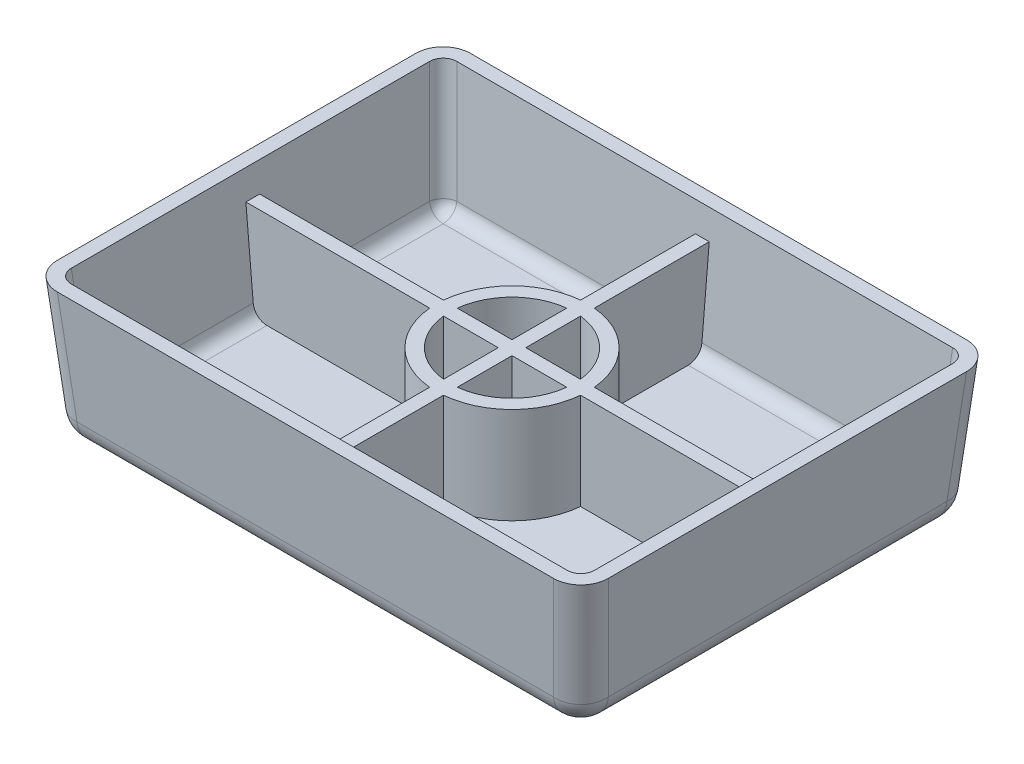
ISO-10303-21;
HEADER;
FILE_DESCRIPTION(('STEP AP214'),'2;1');
FILE_NAME('part.step','',(''),(''),'','','');
FILE_SCHEMA(('AUTOMOTIVE_DESIGN { 1 0 10303 214 1 1 1 1 }'));
ENDSEC;
DATA;
#1=APPLICATION_CONTEXT('core data for automotive mechanical design processes');
#2=APPLICATION_PROTOCOL_DEFINITION('international standard','automotive_design',2000,#1);
#3=PRODUCT_CONTEXT('',#1,'mechanical');
#4=PRODUCT('Part','Part','',(#3));
#5=PRODUCT_RELATED_PRODUCT_CATEGORY('part','',(#4));
#6=PRODUCT_DEFINITION_FORMATION('','',#4);
#7=PRODUCT_DEFINITION_CONTEXT('part definition',#1,'design');
#8=PRODUCT_DEFINITION('design','',#6,#7);
#9=PRODUCT_DEFINITION_SHAPE('','',#8);
#10=(LENGTH_UNIT() NAMED_UNIT(*) SI_UNIT(.MILLI.,.METRE.));
#11=(NAMED_UNIT(*) PLANE_ANGLE_UNIT() SI_UNIT($,.RADIAN.));
#12=(NAMED_UNIT(*) SI_UNIT($,.STERADIAN.) SOLID_ANGLE_UNIT());
#13=UNCERTAINTY_MEASURE_WITH_UNIT(LENGTH_MEASURE(1.E-05),#10,'distance_accuracy_value','');
#14=(GEOMETRIC_REPRESENTATION_CONTEXT(3) GLOBAL_UNCERTAINTY_ASSIGNED_CONTEXT((#13)) GLOBAL_UNIT_ASSIGNED_CONTEXT((#10,
#11,#12)) REPRESENTATION_CONTEXT('',''));
#15=CARTESIAN_POINT('',(0.,0.,0.));
#16=DIRECTION('',(0.,0.,1.));
#17=DIRECTION('',(1.,0.,0.));
#18=AXIS2_PLACEMENT_3D('',#15,#16,#17);
#19=CARTESIAN_POINT('',(-50.8,-22.86,-38.1));
#20=DIRECTION('',(0.,-1.,0.));
#21=DIRECTION('',(0.,0.,-1.));
#22=AXIS2_PLACEMENT_3D('',#19,#20,#21);
#23=PLANE('',#22);
#24=DIRECTION('',(-1.,0.,0.));
#25=VECTOR('',#24,1.);
#26=CARTESIAN_POINT('',(-50.8,-22.86,-1.27));
#27=LINE('',#26,#25);
#28=CARTESIAN_POINT('',(-13.9121529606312,-22.86,-1.27));
#29=VERTEX_POINT('',#28);
#30=CARTESIAN_POINT('',(-43.922825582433,-22.86,-1.27));
#31=VERTEX_POINT('',#30);
#32=EDGE_CURVE('E622',#29,#31,#27,.T.);
#33=ORIENTED_EDGE('',*,*,#32,.F.);
#34=CARTESIAN_POINT('',(0.,-22.86,0.));
#35=DIRECTION('',(0.,-1.,0.));
#36=DIRECTION('',(0.,0.,-1.));
#37=AXIS2_PLACEMENT_3D('',#34,#35,#36);
#38=CIRCLE('',#37,13.97);
#39=CARTESIAN_POINT('',(-1.27,-22.86,-13.9121529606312));
#40=VERTEX_POINT('',#39);
#41=EDGE_CURVE('E551',#40,#29,#38,.F.);
#42=ORIENTED_EDGE('',*,*,#41,.F.);
#43=DIRECTION('',(0.,0.,-1.));
#44=VECTOR('',#43,1.);
#45=CARTESIAN_POINT('',(-1.27,-22.86,-38.1));
#46=LINE('',#45,#44);
#47=CARTESIAN_POINT('',(-1.27,-22.86,-31.222825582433));
#48=VERTEX_POINT('',#47);
#49=EDGE_CURVE('E389',#40,#48,#46,.T.);
#50=ORIENTED_EDGE('',*,*,#49,.T.);
#51=DIRECTION('',(1.,0.,0.));
#52=VECTOR('',#51,1.);
#53=CARTESIAN_POINT('',(-50.8,-22.86,-31.222825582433));
#54=LINE('',#53,#52);
#55=CARTESIAN_POINT('',(-43.922825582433,-22.86,-31.222825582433));
#56=VERTEX_POINT('',#55);
#57=EDGE_CURVE('E762',#56,#48,#54,.T.);
#58=ORIENTED_EDGE('',*,*,#57,.F.);
#59=DIRECTION('',(0.,0.,-1.));
#60=VECTOR('',#59,1.);
#61=CARTESIAN_POINT('',(-43.922825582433,-22.86,-38.1));
#62=LINE('',#61,#60);
#63=EDGE_CURVE('E707',#31,#56,#62,.T.);
#64=ORIENTED_EDGE('',*,*,#63,.F.);
#65=EDGE_LOOP('',(#33,#42,#50,#58,#64));
#66=FACE_BOUND('',#65,.T.);
#67=ADVANCED_FACE('F29',(#66),#23,.F.);
#68=CARTESIAN_POINT('',(0.,-5.08,0.));
#69=DIRECTION('',(0.,-1.,0.));
#70=DIRECTION('',(0.,0.,-1.));
#71=AXIS2_PLACEMENT_3D('',#68,#69,#70);
#72=CYLINDRICAL_SURFACE('',#71,11.43);
#73=CARTESIAN_POINT('',(0.,-22.86,0.));
#74=DIRECTION('',(0.,-1.,0.));
#75=DIRECTION('',(0.,0.,-1.));
#76=AXIS2_PLACEMENT_3D('',#73,#74,#75);
#77=CIRCLE('',#76,11.43);
#78=CARTESIAN_POINT('',(11.3592253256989,-22.86,-1.27));
#79=VERTEX_POINT('',#78);
#80=CARTESIAN_POINT('',(1.27,-22.86,-11.3592253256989));
#81=VERTEX_POINT('',#80);
#82=EDGE_CURVE('E411',#79,#81,#77,.F.);
#83=ORIENTED_EDGE('',*,*,#82,.F.);
#84=DIRECTION('',(0.,-1.,0.));
#85=VECTOR('',#84,1.);
#86=CARTESIAN_POINT('',(11.3592253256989,-5.08,-1.27));
#87=LINE('',#86,#85);
#88=CARTESIAN_POINT('',(11.3592253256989,-5.08,-1.27));
#89=VERTEX_POINT('',#88);
#90=EDGE_CURVE('E1442',#79,#89,#87,.F.);
#91=ORIENTED_EDGE('',*,*,#90,.T.);
#92=CARTESIAN_POINT('',(0.,-5.08,0.));
#93=DIRECTION('',(0.,-1.,0.));
#94=DIRECTION('',(0.,0.,-1.));
#95=AXIS2_PLACEMENT_3D('',#92,#93,#94);
#96=CIRCLE('',#95,11.43);
#97=CARTESIAN_POINT('',(1.27,-5.08,-11.3592253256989));
#98=VERTEX_POINT('',#97);
#99=EDGE_CURVE('E400',#89,#98,#96,.F.);
#100=ORIENTED_EDGE('',*,*,#99,.T.);
#101=DIRECTION('',(0.,-1.,0.));
#102=VECTOR('',#101,1.);
#103=CARTESIAN_POINT('',(1.27,-5.08,-11.3592253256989));
#104=LINE('',#103,#102);
#105=EDGE_CURVE('E649',#98,#81,#104,.T.);
#106=ORIENTED_EDGE('',*,*,#105,.T.);
#107=EDGE_LOOP('',(#83,#91,#100,#106));
#108=FACE_BOUND('',#107,.T.);
#109=ADVANCED_FACE('F864',(#108),#72,.F.);
#110=CARTESIAN_POINT('',(0.,-5.08,0.));
#111=DIRECTION('',(0.,-1.,0.));
#112=DIRECTION('',(0.,0.,-1.));
#113=AXIS2_PLACEMENT_3D('',#110,#111,#112);
#114=CYLINDRICAL_SURFACE('',#113,13.97);
#115=DIRECTION('',(0.,-1.,0.));
#116=VECTOR('',#115,1.);
#117=CARTESIAN_POINT('',(13.9121529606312,-5.08,-1.27));
#118=LINE('',#117,#116);
#119=CARTESIAN_POINT('',(13.9121529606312,-22.86,-1.27));
#120=VERTEX_POINT('',#119);
#121=CARTESIAN_POINT('',(13.9121529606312,-5.08,-1.27));
#122=VERTEX_POINT('',#121);
#123=EDGE_CURVE('E375',#120,#122,#118,.F.);
#124=ORIENTED_EDGE('',*,*,#123,.F.);
#125=CARTESIAN_POINT('',(1.27,-22.86,-13.9121529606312));
#126=VERTEX_POINT('',#125);
#127=EDGE_CURVE('E550',#120,#126,#38,.F.);
#128=ORIENTED_EDGE('',*,*,#127,.T.);
#129=DIRECTION('',(0.,-1.,0.));
#130=VECTOR('',#129,1.);
#131=CARTESIAN_POINT('',(1.27,-5.08,-13.9121529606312));
#132=LINE('',#131,#130);
#133=CARTESIAN_POINT('',(1.27,-5.08,-13.9121529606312));
#134=VERTEX_POINT('',#133);
#135=EDGE_CURVE('E386',#134,#126,#132,.T.);
#136=ORIENTED_EDGE('',*,*,#135,.F.);
#137=CARTESIAN_POINT('',(0.,-5.08,0.));
#138=DIRECTION('',(0.,-1.,0.));
#139=DIRECTION('',(0.,0.,-1.));
#140=AXIS2_PLACEMENT_3D('',#137,#138,#139);
#141=CIRCLE('',#140,13.97);
#142=EDGE_CURVE('E365',#122,#134,#141,.F.);
#143=ORIENTED_EDGE('',*,*,#142,.F.);
#144=EDGE_LOOP('',(#124,#128,#136,#143));
#145=FACE_BOUND('',#144,.T.);
#146=ADVANCED_FACE('F384',(#145),#114,.T.);
#147=DIRECTION('',(-1.,0.,0.));
#148=VECTOR('',#147,1.);
#149=CARTESIAN_POINT('',(-50.8,-22.86,-1.27));
#150=LINE('',#149,#148);
#151=CARTESIAN_POINT('',(1.27,-22.86,-1.27));
#152=VERTEX_POINT('',#151);
#153=EDGE_CURVE('E46',#79,#152,#150,.T.);
#154=ORIENTED_EDGE('',*,*,#153,.F.);
#155=ORIENTED_EDGE('',*,*,#82,.T.);
#156=DIRECTION('',(0.,0.,-1.));
#157=VECTOR('',#156,1.);
#158=CARTESIAN_POINT('',(1.27,-22.86,-38.1));
#159=LINE('',#158,#157);
#160=EDGE_CURVE('E554',#152,#81,#159,.T.);
#161=ORIENTED_EDGE('',*,*,#160,.F.);
#162=EDGE_LOOP('',(#154,#155,#161));
#163=FACE_BOUND('',#162,.T.);
#164=ADVANCED_FACE('F866',(#163),#23,.F.);
#165=DIRECTION('',(1.,0.,0.));
#166=VECTOR('',#165,1.);
#167=CARTESIAN_POINT('',(-50.8,-22.86,1.27));
#168=LINE('',#167,#166);
#169=CARTESIAN_POINT('',(13.9121529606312,-22.86,1.27));
#170=VERTEX_POINT('',#169);
#171=CARTESIAN_POINT('',(43.922825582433,-22.86,1.27));
#172=VERTEX_POINT('',#171);
#173=EDGE_CURVE('E623',#170,#172,#168,.T.);
#174=ORIENTED_EDGE('',*,*,#173,.F.);
#175=CARTESIAN_POINT('',(1.27,-22.86,13.9121529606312));
#176=VERTEX_POINT('',#175);
#177=EDGE_CURVE('E556',#176,#170,#38,.F.);
#178=ORIENTED_EDGE('',*,*,#177,.F.);
#179=DIRECTION('',(0.,0.,1.));
#180=VECTOR('',#179,1.);
#181=CARTESIAN_POINT('',(1.27,-22.86,-38.1));
#182=LINE('',#181,#180);
#183=CARTESIAN_POINT('',(1.27,-22.86,31.222825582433));
#184=VERTEX_POINT('',#183);
#185=EDGE_CURVE('E676',#176,#184,#182,.T.);
#186=ORIENTED_EDGE('',*,*,#185,.T.);
#187=DIRECTION('',(1.,0.,0.));
#188=VECTOR('',#187,1.);
#189=CARTESIAN_POINT('',(-50.8,-22.86,31.222825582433));
#190=LINE('',#189,#188);
#191=CARTESIAN_POINT('',(43.922825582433,-22.86,31.222825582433));
#192=VERTEX_POINT('',#191);
#193=EDGE_CURVE('E760',#192,#184,#190,.F.);
#194=ORIENTED_EDGE('',*,*,#193,.F.);
#195=DIRECTION('',(0.,0.,-1.));
#196=VECTOR('',#195,1.);
#197=CARTESIAN_POINT('',(43.922825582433,-22.86,-38.1));
#198=LINE('',#197,#196);
#199=EDGE_CURVE('E758',#172,#192,#198,.F.);
#200=ORIENTED_EDGE('',*,*,#199,.F.);
#201=EDGE_LOOP('',(#174,#178,#186,#194,#200));
#202=FACE_BOUND('',#201,.T.);
#203=ADVANCED_FACE('F803',(#202),#23,.F.);
#204=CARTESIAN_POINT('',(48.269665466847,0.221375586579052,38.1));
#205=DIRECTION('',(0.996194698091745,-0.0871557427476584,0.));
#206=DIRECTION('',(0.0871557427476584,0.996194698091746,0.));
#207=AXIS2_PLACEMENT_3D('',#204,#205,#206);
#208=PLANE('',#207);
#209=DIRECTION('',(0.0871557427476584,0.996194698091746,0.));
#210=VECTOR('',#209,1.);
#211=CARTESIAN_POINT('',(48.269665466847,0.221375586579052,1.27));
#212=LINE('',#211,#210);
#213=CARTESIAN_POINT('',(46.453160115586,-20.5413755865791,1.27));
#214=VERTEX_POINT('',#213);
#215=CARTESIAN_POINT('',(47.8058552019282,-5.08,1.27));
#216=VERTEX_POINT('',#215);
#217=EDGE_CURVE('E626',#214,#216,#212,.T.);
#218=ORIENTED_EDGE('',*,*,#217,.F.);
#219=DIRECTION('',(0.,0.,1.));
#220=VECTOR('',#219,1.);
#221=CARTESIAN_POINT('',(46.453160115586,-20.5413755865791,38.1));
#222=LINE('',#221,#220);
#223=CARTESIAN_POINT('',(46.453160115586,-20.5413755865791,31.222825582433));
#224=VERTEX_POINT('',#223);
#225=EDGE_CURVE('E798',#224,#214,#222,.F.);
#226=ORIENTED_EDGE('',*,*,#225,.F.);
#227=DIRECTION('',(0.0868265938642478,0.992432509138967,0.0868265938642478));
#228=VECTOR('',#227,1.);
#229=CARTESIAN_POINT('',(47.5418692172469,-8.09737361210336,32.3115346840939));
#230=LINE('',#229,#228);
#231=CARTESIAN_POINT('',(48.2502976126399,0.,33.0199630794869));
#232=VERTEX_POINT('',#231);
#233=EDGE_CURVE('E767',#232,#224,#230,.F.);
#234=ORIENTED_EDGE('',*,*,#233,.F.);
#235=DIRECTION('',(0.,0.,-1.));
#236=VECTOR('',#235,1.);
#237=CARTESIAN_POINT('',(48.2502976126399,0.,38.1));
#238=LINE('',#237,#236);
#239=CARTESIAN_POINT('',(48.2502976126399,0.,-33.0199630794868));
#240=VERTEX_POINT('',#239);
#241=EDGE_CURVE('E451',#232,#240,#238,.T.);
#242=ORIENTED_EDGE('',*,*,#241,.T.);
#243=DIRECTION('',(0.0868265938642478,0.992432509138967,-0.0868265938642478));
#244=VECTOR('',#243,1.);
#245=CARTESIAN_POINT('',(47.7333561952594,-5.90866743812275,-32.5030216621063));
#246=LINE('',#245,#244);
#247=CARTESIAN_POINT('',(46.4531601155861,-20.5413755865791,-31.222825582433));
#248=VERTEX_POINT('',#247);
#249=EDGE_CURVE('E830',#248,#240,#246,.T.);
#250=ORIENTED_EDGE('',*,*,#249,.F.);
#251=CARTESIAN_POINT('',(46.4531601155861,-20.5413755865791,-1.27));
#252=VERTEX_POINT('',#251);
#253=EDGE_CURVE('E746',#252,#248,#222,.F.);
#254=ORIENTED_EDGE('',*,*,#253,.F.);
#255=DIRECTION('',(0.0871557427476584,0.996194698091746,0.));
#256=VECTOR('',#255,1.);
#257=CARTESIAN_POINT('',(48.269665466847,0.221375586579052,-1.27));
#258=LINE('',#257,#256);
#259=CARTESIAN_POINT('',(47.8058552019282,-5.08,-1.27));
#260=VERTEX_POINT('',#259);
#261=EDGE_CURVE('E618',#252,#260,#258,.T.);
#262=ORIENTED_EDGE('',*,*,#261,.T.);
#263=DIRECTION('',(0.,0.,1.));
#264=VECTOR('',#263,1.);
#265=CARTESIAN_POINT('',(47.8058552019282,-5.08,38.1));
#266=LINE('',#265,#264);
#267=EDGE_CURVE('E369',#260,#216,#266,.T.);
#268=ORIENTED_EDGE('',*,*,#267,.T.);
#269=EDGE_LOOP('',(#218,#226,#234,#242,#250,#254,#262,#268));
#270=FACE_BOUND('',#269,.T.);
#271=ADVANCED_FACE('F743',(#270),#208,.F.);
#272=CARTESIAN_POINT('',(-43.922825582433,-20.32,38.1));
#273=DIRECTION('',(0.,0.,1.));
#274=DIRECTION('',(1.,0.,0.));
#275=AXIS2_PLACEMENT_3D('',#272,#273,#274);
#276=CYLINDRICAL_SURFACE('',#275,2.54);
#277=CARTESIAN_POINT('',(-43.922825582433,-20.32,-1.27));
#278=DIRECTION('',(0.,0.,1.));
#279=DIRECTION('',(1.,0.,0.));
#280=AXIS2_PLACEMENT_3D('',#277,#278,#279);
#281=CIRCLE('',#280,2.54);
#282=CARTESIAN_POINT('',(-46.453160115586,-20.5413755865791,-1.27));
#283=VERTEX_POINT('',#282);
#284=EDGE_CURVE('E38',#31,#283,#281,.F.);
#285=ORIENTED_EDGE('',*,*,#284,.F.);
#286=ORIENTED_EDGE('',*,*,#63,.T.);
#287=CARTESIAN_POINT('',(-43.922825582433,-20.32,-31.222825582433));
#288=DIRECTION('',(0.,0.,1.));
#289=DIRECTION('',(1.,0.,0.));
#290=AXIS2_PLACEMENT_3D('',#287,#288,#289);
#291=CIRCLE('',#290,2.54);
#292=CARTESIAN_POINT('',(-46.453160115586,-20.5413755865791,-31.222825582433));
#293=VERTEX_POINT('',#292);
#294=EDGE_CURVE('E776',#293,#56,#291,.T.);
#295=ORIENTED_EDGE('',*,*,#294,.F.);
#296=DIRECTION('',(0.,0.,1.));
#297=VECTOR('',#296,1.);
#298=CARTESIAN_POINT('',(-46.453160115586,-20.5413755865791,38.1));
#299=LINE('',#298,#297);
#300=EDGE_CURVE('E931',#293,#283,#299,.T.);
#301=ORIENTED_EDGE('',*,*,#300,.T.);
#302=EDGE_LOOP('',(#285,#286,#295,#301));
#303=FACE_BOUND('',#302,.T.);
#304=ADVANCED_FACE('F859',(#303),#276,.F.);
#305=CARTESIAN_POINT('',(43.922825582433,-20.32,38.1));
#306=DIRECTION('',(0.,0.,-1.));
#307=DIRECTION('',(-1.,0.,0.));
#308=AXIS2_PLACEMENT_3D('',#305,#306,#307);
#309=CYLINDRICAL_SURFACE('',#308,2.54);
#310=CARTESIAN_POINT('',(43.922825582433,-20.32,1.27));
#311=DIRECTION('',(0.,0.,-1.));
#312=DIRECTION('',(-1.,0.,0.));
#313=AXIS2_PLACEMENT_3D('',#310,#311,#312);
#314=CIRCLE('',#313,2.54);
#315=EDGE_CURVE('E576',#172,#214,#314,.F.);
#316=ORIENTED_EDGE('',*,*,#315,.F.);
#317=ORIENTED_EDGE('',*,*,#199,.T.);
#318=CARTESIAN_POINT('',(43.922825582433,-20.32,31.222825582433));
#319=DIRECTION('',(0.,0.,1.));
#320=DIRECTION('',(1.,0.,0.));
#321=AXIS2_PLACEMENT_3D('',#318,#319,#320);
#322=CIRCLE('',#321,2.54);
#323=EDGE_CURVE('E435',#192,#224,#322,.T.);
#324=ORIENTED_EDGE('',*,*,#323,.T.);
#325=ORIENTED_EDGE('',*,*,#225,.T.);
#326=EDGE_LOOP('',(#316,#317,#324,#325));
#327=FACE_BOUND('',#326,.T.);
#328=ADVANCED_FACE('F797',(#327),#309,.F.);
#329=CARTESIAN_POINT('',(-1.27,-5.08,-11.3592253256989));
#330=VERTEX_POINT('',#329);
#331=CARTESIAN_POINT('',(-11.3592253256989,-5.08,-1.27));
#332=VERTEX_POINT('',#331);
#333=EDGE_CURVE('E405',#330,#332,#96,.F.);
#334=ORIENTED_EDGE('',*,*,#333,.T.);
#335=DIRECTION('',(0.,-1.,0.));
#336=VECTOR('',#335,1.);
#337=CARTESIAN_POINT('',(-11.3592253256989,-5.08,-1.27));
#338=LINE('',#337,#336);
#339=CARTESIAN_POINT('',(-11.3592253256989,-22.86,-1.27));
#340=VERTEX_POINT('',#339);
#341=EDGE_CURVE('E708',#332,#340,#338,.T.);
#342=ORIENTED_EDGE('',*,*,#341,.T.);
#343=CARTESIAN_POINT('',(-1.27,-22.86,-11.3592253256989));
#344=VERTEX_POINT('',#343);
#345=EDGE_CURVE('E418',#344,#340,#77,.F.);
#346=ORIENTED_EDGE('',*,*,#345,.F.);
#347=DIRECTION('',(0.,-1.,0.));
#348=VECTOR('',#347,1.);
#349=CARTESIAN_POINT('',(-1.27,-5.08,-11.3592253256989));
#350=LINE('',#349,#348);
#351=EDGE_CURVE('E658',#330,#344,#350,.T.);
#352=ORIENTED_EDGE('',*,*,#351,.F.);
#353=EDGE_LOOP('',(#334,#342,#346,#352));
#354=FACE_BOUND('',#353,.T.);
#355=ADVANCED_FACE('F873',(#354),#72,.F.);
#356=DIRECTION('',(0.,-1.,0.));
#357=VECTOR('',#356,1.);
#358=CARTESIAN_POINT('',(-13.9121529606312,-5.08,-1.27));
#359=LINE('',#358,#357);
#360=CARTESIAN_POINT('',(-13.9121529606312,-5.08,-1.27));
#361=VERTEX_POINT('',#360);
#362=EDGE_CURVE('E382',#361,#29,#359,.T.);
#363=ORIENTED_EDGE('',*,*,#362,.F.);
#364=CARTESIAN_POINT('',(-1.27,-5.08,-13.9121529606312));
#365=VERTEX_POINT('',#364);
#366=EDGE_CURVE('E393',#365,#361,#141,.F.);
#367=ORIENTED_EDGE('',*,*,#366,.F.);
#368=DIRECTION('',(0.,-1.,0.));
#369=VECTOR('',#368,1.);
#370=CARTESIAN_POINT('',(-1.27,-5.08,-13.9121529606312));
#371=LINE('',#370,#369);
#372=EDGE_CURVE('E664',#365,#40,#371,.T.);
#373=ORIENTED_EDGE('',*,*,#372,.T.);
#374=ORIENTED_EDGE('',*,*,#41,.T.);
#375=EDGE_LOOP('',(#363,#367,#373,#374));
#376=FACE_BOUND('',#375,.T.);
#377=ADVANCED_FACE('F702',(#376),#114,.T.);
#378=DIRECTION('',(-1.,0.,0.));
#379=VECTOR('',#378,1.);
#380=CARTESIAN_POINT('',(-50.8,-22.86,-1.27));
#381=LINE('',#380,#379);
#382=CARTESIAN_POINT('',(-1.27,-22.86,-1.27));
#383=VERTEX_POINT('',#382);
#384=EDGE_CURVE('E710',#383,#340,#381,.T.);
#385=ORIENTED_EDGE('',*,*,#384,.F.);
#386=DIRECTION('',(0.,0.,-1.));
#387=VECTOR('',#386,1.);
#388=CARTESIAN_POINT('',(-1.27,-22.86,-38.1));
#389=LINE('',#388,#387);
#390=EDGE_CURVE('E570',#383,#344,#389,.T.);
#391=ORIENTED_EDGE('',*,*,#390,.T.);
#392=ORIENTED_EDGE('',*,*,#345,.T.);
#393=EDGE_LOOP('',(#385,#391,#392));
#394=FACE_BOUND('',#393,.T.);
#395=ADVANCED_FACE('F1225',(#394),#23,.F.);
#396=CARTESIAN_POINT('',(-1.27,-5.08,19.3051499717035));
#397=DIRECTION('',(-1.,0.,0.));
#398=DIRECTION('',(0.,0.,1.));
#399=AXIS2_PLACEMENT_3D('',#396,#397,#398);
#400=PLANE('',#399);
#401=ORIENTED_EDGE('',*,*,#390,.F.);
#402=DIRECTION('',(0.,1.,0.));
#403=VECTOR('',#402,1.);
#404=CARTESIAN_POINT('',(-1.27,-5.08,-1.27));
#405=LINE('',#404,#403);
#406=CARTESIAN_POINT('',(-1.27,-5.08,-1.27));
#407=VERTEX_POINT('',#406);
#408=EDGE_CURVE('E1447',#383,#407,#405,.T.);
#409=ORIENTED_EDGE('',*,*,#408,.T.);
#410=DIRECTION('',(0.,0.,1.));
#411=VECTOR('',#410,1.);
#412=CARTESIAN_POINT('',(-1.27,-5.08,19.3051499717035));
#413=LINE('',#412,#411);
#414=EDGE_CURVE('E646',#407,#330,#413,.F.);
#415=ORIENTED_EDGE('',*,*,#414,.T.);
#416=ORIENTED_EDGE('',*,*,#351,.T.);
#417=EDGE_LOOP('',(#401,#409,#415,#416));
#418=FACE_BOUND('',#417,.T.);
#419=ADVANCED_FACE('F1232',(#418),#400,.T.);
#420=CARTESIAN_POINT('',(1.27,-5.08,19.3051499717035));
#421=DIRECTION('',(-1.,0.,0.));
#422=DIRECTION('',(0.,0.,1.));
#423=AXIS2_PLACEMENT_3D('',#420,#421,#422);
#424=PLANE('',#423);
#425=DIRECTION('',(0.,1.,0.));
#426=VECTOR('',#425,1.);
#427=CARTESIAN_POINT('',(1.27,-5.08,-1.27));
#428=LINE('',#427,#426);
#429=CARTESIAN_POINT('',(1.27,-5.08,-1.27));
#430=VERTEX_POINT('',#429);
#431=EDGE_CURVE('E33',#152,#430,#428,.T.);
#432=ORIENTED_EDGE('',*,*,#431,.F.);
#433=ORIENTED_EDGE('',*,*,#160,.T.);
#434=ORIENTED_EDGE('',*,*,#105,.F.);
#435=DIRECTION('',(0.,0.,1.));
#436=VECTOR('',#435,1.);
#437=CARTESIAN_POINT('',(1.27,-5.08,19.3051499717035));
#438=LINE('',#437,#436);
#439=EDGE_CURVE('E595',#430,#98,#438,.F.);
#440=ORIENTED_EDGE('',*,*,#439,.F.);
#441=EDGE_LOOP('',(#432,#433,#434,#440));
#442=FACE_BOUND('',#441,.T.);
#443=ADVANCED_FACE('F1224',(#442),#424,.F.);
#444=CARTESIAN_POINT('',(-13.9121529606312,-22.86,1.27));
#445=VERTEX_POINT('',#444);
#446=CARTESIAN_POINT('',(-1.27,-22.86,13.9121529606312));
#447=VERTEX_POINT('',#446);
#448=EDGE_CURVE('E555',#445,#447,#38,.F.);
#449=ORIENTED_EDGE('',*,*,#448,.F.);
#450=DIRECTION('',(-1.,0.,0.));
#451=VECTOR('',#450,1.);
#452=CARTESIAN_POINT('',(-50.8,-22.86,1.27));
#453=LINE('',#452,#451);
#454=CARTESIAN_POINT('',(-43.922825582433,-22.86,1.27));
#455=VERTEX_POINT('',#454);
#456=EDGE_CURVE('E631',#445,#455,#453,.T.);
#457=ORIENTED_EDGE('',*,*,#456,.T.);
#458=CARTESIAN_POINT('',(-43.922825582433,-22.86,31.222825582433));
#459=VERTEX_POINT('',#458);
#460=EDGE_CURVE('E768',#459,#455,#62,.T.);
#461=ORIENTED_EDGE('',*,*,#460,.F.);
#462=CARTESIAN_POINT('',(-1.27,-22.86,31.222825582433));
#463=VERTEX_POINT('',#462);
#464=EDGE_CURVE('E757',#463,#459,#190,.F.);
#465=ORIENTED_EDGE('',*,*,#464,.F.);
#466=DIRECTION('',(0.,0.,1.));
#467=VECTOR('',#466,1.);
#468=CARTESIAN_POINT('',(-1.27,-22.86,-38.1));
#469=LINE('',#468,#467);
#470=EDGE_CURVE('E681',#447,#463,#469,.T.);
#471=ORIENTED_EDGE('',*,*,#470,.F.);
#472=EDGE_LOOP('',(#449,#457,#461,#465,#471));
#473=FACE_BOUND('',#472,.T.);
#474=ADVANCED_FACE('F903',(#473),#23,.F.);
#475=CARTESIAN_POINT('',(-50.8,0.221375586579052,35.569665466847));
#476=DIRECTION('',(0.,-0.0871557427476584,0.996194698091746));
#477=DIRECTION('',(0.,-0.996194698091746,-0.0871557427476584));
#478=AXIS2_PLACEMENT_3D('',#475,#476,#477);
#479=PLANE('',#478);
#480=DIRECTION('',(0.,0.996194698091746,0.0871557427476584));
#481=VECTOR('',#480,1.);
#482=CARTESIAN_POINT('',(-1.27,0.221375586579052,35.569665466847));
#483=LINE('',#482,#481);
#484=CARTESIAN_POINT('',(-1.27,-20.5413755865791,33.753160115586));
#485=VERTEX_POINT('',#484);
#486=CARTESIAN_POINT('',(-1.27,-5.08,35.1058552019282));
#487=VERTEX_POINT('',#486);
#488=EDGE_CURVE('E679',#485,#487,#483,.T.);
#489=ORIENTED_EDGE('',*,*,#488,.F.);
#490=DIRECTION('',(1.,0.,0.));
#491=VECTOR('',#490,1.);
#492=CARTESIAN_POINT('',(-50.8,-20.5413755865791,33.753160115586));
#493=LINE('',#492,#491);
#494=CARTESIAN_POINT('',(-43.922825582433,-20.5413755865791,33.753160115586));
#495=VERTEX_POINT('',#494);
#496=EDGE_CURVE('E789',#495,#485,#493,.T.);
#497=ORIENTED_EDGE('',*,*,#496,.F.);
#498=DIRECTION('',(-0.0868265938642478,0.992432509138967,0.0868265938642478));
#499=VECTOR('',#498,1.);
#500=CARTESIAN_POINT('',(-45.7774825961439,0.657451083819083,35.6078171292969));
#501=LINE('',#500,#499);
#502=CARTESIAN_POINT('',(-45.7199630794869,0.,35.5502976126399));
#503=VERTEX_POINT('',#502);
#504=EDGE_CURVE('E787',#503,#495,#501,.F.);
#505=ORIENTED_EDGE('',*,*,#504,.F.);
#506=DIRECTION('',(1.,0.,0.));
#507=VECTOR('',#506,1.);
#508=CARTESIAN_POINT('',(-50.8,0.,35.5502976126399));
#509=LINE('',#508,#507);
#510=CARTESIAN_POINT('',(45.7199630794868,0.,35.5502976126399));
#511=VERTEX_POINT('',#510);
#512=EDGE_CURVE('E443',#503,#511,#509,.T.);
#513=ORIENTED_EDGE('',*,*,#512,.T.);
#514=DIRECTION('',(0.0868265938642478,0.992432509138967,0.0868265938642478));
#515=VECTOR('',#514,1.);
#516=CARTESIAN_POINT('',(45.0115346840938,-8.09737361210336,34.8418692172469));
#517=LINE('',#516,#515);
#518=CARTESIAN_POINT('',(43.922825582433,-20.5413755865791,33.753160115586));
#519=VERTEX_POINT('',#518);
#520=EDGE_CURVE('E460',#519,#511,#517,.T.);
#521=ORIENTED_EDGE('',*,*,#520,.F.);
#522=CARTESIAN_POINT('',(1.27,-20.5413755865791,33.753160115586));
#523=VERTEX_POINT('',#522);
#524=EDGE_CURVE('E792',#523,#519,#493,.T.);
#525=ORIENTED_EDGE('',*,*,#524,.F.);
#526=DIRECTION('',(0.,0.996194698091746,0.0871557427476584));
#527=VECTOR('',#526,1.);
#528=CARTESIAN_POINT('',(1.27,0.221375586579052,35.569665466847));
#529=LINE('',#528,#527);
#530=CARTESIAN_POINT('',(1.27,-5.08,35.1058552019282));
#531=VERTEX_POINT('',#530);
#532=EDGE_CURVE('E673',#523,#531,#529,.T.);
#533=ORIENTED_EDGE('',*,*,#532,.T.);
#534=DIRECTION('',(-1.,0.,0.));
#535=VECTOR('',#534,1.);
#536=CARTESIAN_POINT('',(-50.8,-5.08,35.1058552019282));
#537=LINE('',#536,#535);
#538=EDGE_CURVE('E667',#531,#487,#537,.T.);
#539=ORIENTED_EDGE('',*,*,#538,.T.);
#540=EDGE_LOOP('',(#489,#497,#505,#513,#521,#525,#533,#539));
#541=FACE_BOUND('',#540,.T.);
#542=ADVANCED_FACE('F810',(#541),#479,.F.);
#543=CARTESIAN_POINT('',(-50.8,-20.32,-31.222825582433));
#544=DIRECTION('',(-1.,0.,0.));
#545=DIRECTION('',(0.,0.,1.));
#546=AXIS2_PLACEMENT_3D('',#543,#544,#545);
#547=CYLINDRICAL_SURFACE('',#546,2.54);
#548=CARTESIAN_POINT('',(1.27,-20.32,-31.222825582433));
#549=DIRECTION('',(-1.,0.,0.));
#550=DIRECTION('',(0.,0.,1.));
#551=AXIS2_PLACEMENT_3D('',#548,#549,#550);
#552=CIRCLE('',#551,2.54);
#553=CARTESIAN_POINT('',(1.27,-22.86,-31.222825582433));
#554=VERTEX_POINT('',#553);
#555=CARTESIAN_POINT('',(1.27,-20.5413755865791,-33.753160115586));
#556=VERTEX_POINT('',#555);
#557=EDGE_CURVE('E559',#554,#556,#552,.F.);
#558=ORIENTED_EDGE('',*,*,#557,.F.);
#559=CARTESIAN_POINT('',(43.922825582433,-22.86,-31.222825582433));
#560=VERTEX_POINT('',#559);
#561=EDGE_CURVE('E771',#554,#560,#54,.T.);
#562=ORIENTED_EDGE('',*,*,#561,.T.);
#563=CARTESIAN_POINT('',(43.922825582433,-20.32,-31.222825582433));
#564=DIRECTION('',(-1.,0.,0.));
#565=DIRECTION('',(0.,-1.,0.));
#566=AXIS2_PLACEMENT_3D('',#563,#564,#565);
#567=CIRCLE('',#566,2.54);
#568=CARTESIAN_POINT('',(43.922825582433,-20.5413755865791,-33.753160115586));
#569=VERTEX_POINT('',#568);
#570=EDGE_CURVE('E779',#560,#569,#567,.F.);
#571=ORIENTED_EDGE('',*,*,#570,.T.);
#572=DIRECTION('',(1.,0.,0.));
#573=VECTOR('',#572,1.);
#574=CARTESIAN_POINT('',(-50.8,-20.5413755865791,-33.753160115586));
#575=LINE('',#574,#573);
#576=EDGE_CURVE('E832',#569,#556,#575,.F.);
#577=ORIENTED_EDGE('',*,*,#576,.T.);
#578=EDGE_LOOP('',(#558,#562,#571,#577));
#579=FACE_BOUND('',#578,.T.);
#580=ADVANCED_FACE('F844',(#579),#547,.F.);
#581=CARTESIAN_POINT('',(-50.8,-20.32,31.222825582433));
#582=DIRECTION('',(1.,0.,0.));
#583=DIRECTION('',(0.,0.,-1.));
#584=AXIS2_PLACEMENT_3D('',#581,#582,#583);
#585=CYLINDRICAL_SURFACE('',#584,2.54);
#586=CARTESIAN_POINT('',(-1.27,-20.32,31.222825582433));
#587=DIRECTION('',(1.,0.,0.));
#588=DIRECTION('',(0.,0.,-1.));
#589=AXIS2_PLACEMENT_3D('',#586,#587,#588);
#590=CIRCLE('',#589,2.54);
#591=EDGE_CURVE('E562',#463,#485,#590,.F.);
#592=ORIENTED_EDGE('',*,*,#591,.F.);
#593=ORIENTED_EDGE('',*,*,#464,.T.);
#594=CARTESIAN_POINT('',(-43.922825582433,-20.32,31.222825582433));
#595=DIRECTION('',(1.,0.,0.));
#596=DIRECTION('',(0.,0.,-1.));
#597=AXIS2_PLACEMENT_3D('',#594,#595,#596);
#598=CIRCLE('',#597,2.54);
#599=EDGE_CURVE('E427',#495,#459,#598,.T.);
#600=ORIENTED_EDGE('',*,*,#599,.F.);
#601=ORIENTED_EDGE('',*,*,#496,.T.);
#602=EDGE_LOOP('',(#592,#593,#600,#601));
#603=FACE_BOUND('',#602,.T.);
#604=ADVANCED_FACE('F920',(#603),#585,.F.);
#605=DIRECTION('',(0.,-1.,0.));
#606=VECTOR('',#605,1.);
#607=CARTESIAN_POINT('',(11.3592253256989,-5.08,1.27));
#608=LINE('',#607,#606);
#609=CARTESIAN_POINT('',(11.3592253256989,-22.86,1.27));
#610=VERTEX_POINT('',#609);
#611=CARTESIAN_POINT('',(11.3592253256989,-5.08,1.27));
#612=VERTEX_POINT('',#611);
#613=EDGE_CURVE('E54',#610,#612,#608,.F.);
#614=ORIENTED_EDGE('',*,*,#613,.F.);
#615=CARTESIAN_POINT('',(1.27,-22.86,11.3592253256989));
#616=VERTEX_POINT('',#615);
#617=EDGE_CURVE('E416',#616,#610,#77,.F.);
#618=ORIENTED_EDGE('',*,*,#617,.F.);
#619=DIRECTION('',(0.,-1.,0.));
#620=VECTOR('',#619,1.);
#621=CARTESIAN_POINT('',(1.27,-5.08,11.3592253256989));
#622=LINE('',#621,#620);
#623=CARTESIAN_POINT('',(1.27,-5.08,11.3592253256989));
#624=VERTEX_POINT('',#623);
#625=EDGE_CURVE('E645',#616,#624,#622,.F.);
#626=ORIENTED_EDGE('',*,*,#625,.T.);
#627=EDGE_CURVE('E403',#624,#612,#96,.F.);
#628=ORIENTED_EDGE('',*,*,#627,.T.);
#629=EDGE_LOOP('',(#614,#618,#626,#628));
#630=FACE_BOUND('',#629,.T.);
#631=ADVANCED_FACE('F1207',(#630),#72,.F.);
#632=ORIENTED_EDGE('',*,*,#177,.T.);
#633=DIRECTION('',(0.,-1.,0.));
#634=VECTOR('',#633,1.);
#635=CARTESIAN_POINT('',(13.9121529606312,-5.08,1.27));
#636=LINE('',#635,#634);
#637=CARTESIAN_POINT('',(13.9121529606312,-5.08,1.27));
#638=VERTEX_POINT('',#637);
#639=EDGE_CURVE('E727',#170,#638,#636,.F.);
#640=ORIENTED_EDGE('',*,*,#639,.T.);
#641=CARTESIAN_POINT('',(1.27,-5.08,13.9121529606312));
#642=VERTEX_POINT('',#641);
#643=EDGE_CURVE('E388',#642,#638,#141,.F.);
#644=ORIENTED_EDGE('',*,*,#643,.F.);
#645=DIRECTION('',(0.,-1.,0.));
#646=VECTOR('',#645,1.);
#647=CARTESIAN_POINT('',(1.27,-5.08,13.9121529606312));
#648=LINE('',#647,#646);
#649=EDGE_CURVE('E651',#176,#642,#648,.F.);
#650=ORIENTED_EDGE('',*,*,#649,.F.);
#651=EDGE_LOOP('',(#632,#640,#644,#650));
#652=FACE_BOUND('',#651,.T.);
#653=ADVANCED_FACE('F901',(#652),#114,.T.);
#654=ORIENTED_EDGE('',*,*,#617,.T.);
#655=DIRECTION('',(-1.,0.,0.));
#656=VECTOR('',#655,1.);
#657=CARTESIAN_POINT('',(-50.8,-22.86,1.27));
#658=LINE('',#657,#656);
#659=CARTESIAN_POINT('',(1.27,-22.86,1.27));
#660=VERTEX_POINT('',#659);
#661=EDGE_CURVE('E381',#610,#660,#658,.T.);
#662=ORIENTED_EDGE('',*,*,#661,.T.);
#663=EDGE_CURVE('E571',#616,#660,#159,.T.);
#664=ORIENTED_EDGE('',*,*,#663,.F.);
#665=EDGE_LOOP('',(#654,#662,#664));
#666=FACE_BOUND('',#665,.T.);
#667=ADVANCED_FACE('F892',(#666),#23,.F.);
#668=ORIENTED_EDGE('',*,*,#127,.F.);
#669=DIRECTION('',(1.,0.,0.));
#670=VECTOR('',#669,1.);
#671=CARTESIAN_POINT('',(-50.8,-22.86,-1.27));
#672=LINE('',#671,#670);
#673=CARTESIAN_POINT('',(43.922825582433,-22.86,-1.27));
#674=VERTEX_POINT('',#673);
#675=EDGE_CURVE('E378',#120,#674,#672,.T.);
#676=ORIENTED_EDGE('',*,*,#675,.T.);
#677=EDGE_CURVE('E752',#560,#674,#198,.F.);
#678=ORIENTED_EDGE('',*,*,#677,.F.);
#679=ORIENTED_EDGE('',*,*,#561,.F.);
#680=DIRECTION('',(0.,0.,-1.));
#681=VECTOR('',#680,1.);
#682=CARTESIAN_POINT('',(1.27,-22.86,-38.1));
#683=LINE('',#682,#681);
#684=EDGE_CURVE('E686',#126,#554,#683,.T.);
#685=ORIENTED_EDGE('',*,*,#684,.F.);
#686=EDGE_LOOP('',(#668,#676,#678,#679,#685));
#687=FACE_BOUND('',#686,.T.);
#688=ADVANCED_FACE('F881',(#687),#23,.F.);
#689=CARTESIAN_POINT('',(-50.8,0.,-38.1));
#690=DIRECTION('',(0.,-1.,0.));
#691=DIRECTION('',(0.,0.,-1.));
#692=AXIS2_PLACEMENT_3D('',#689,#690,#691);
#693=PLANE('',#692);
#694=DIRECTION('',(-1.,0.,0.));
#695=VECTOR('',#694,1.);
#696=CARTESIAN_POINT('',(-50.8,0.,-38.1));
#697=LINE('',#696,#695);
#698=CARTESIAN_POINT('',(45.7393309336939,0.,-38.1));
#699=VERTEX_POINT('',#698);
#700=CARTESIAN_POINT('',(-45.7393309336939,0.,-38.1));
#701=VERTEX_POINT('',#700);
#702=EDGE_CURVE('E507',#699,#701,#697,.T.);
#703=ORIENTED_EDGE('',*,*,#702,.T.);
#704=CARTESIAN_POINT('',(-45.7005952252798,0.,-33.0005952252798));
#705=DIRECTION('',(0.,-1.,0.));
#706=DIRECTION('',(-0.707106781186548,0.,-0.707106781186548));
#707=AXIS2_PLACEMENT_3D('',#704,#705,#706);
#708=ELLIPSE('',#707,5.11873598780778,5.08);
#709=CARTESIAN_POINT('',(-50.8,0.,-33.0393309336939));
#710=VERTEX_POINT('',#709);
#711=EDGE_CURVE('E548',#701,#710,#708,.F.);
#712=ORIENTED_EDGE('',*,*,#711,.T.);
#713=DIRECTION('',(0.,0.,1.));
#714=VECTOR('',#713,1.);
#715=CARTESIAN_POINT('',(-50.8,0.,38.1));
#716=LINE('',#715,#714);
#717=CARTESIAN_POINT('',(-50.8,0.,33.0393309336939));
#718=VERTEX_POINT('',#717);
#719=EDGE_CURVE('E498',#710,#718,#716,.T.);
#720=ORIENTED_EDGE('',*,*,#719,.T.);
#721=CARTESIAN_POINT('',(-45.7005952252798,0.,33.0005952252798));
#722=DIRECTION('',(0.,-1.,0.));
#723=DIRECTION('',(-0.707106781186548,0.,0.707106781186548));
#724=AXIS2_PLACEMENT_3D('',#721,#722,#723);
#725=ELLIPSE('',#724,5.11873598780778,5.08);
#726=CARTESIAN_POINT('',(-45.7393309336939,0.,38.1));
#727=VERTEX_POINT('',#726);
#728=EDGE_CURVE('E544',#718,#727,#725,.F.);
#729=ORIENTED_EDGE('',*,*,#728,.T.);
#730=DIRECTION('',(1.,0.,0.));
#731=VECTOR('',#730,1.);
#732=CARTESIAN_POINT('',(-50.8,0.,38.1));
#733=LINE('',#732,#731);
#734=CARTESIAN_POINT('',(45.7393309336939,0.,38.1));
#735=VERTEX_POINT('',#734);
#736=EDGE_CURVE('E501',#727,#735,#733,.T.);
#737=ORIENTED_EDGE('',*,*,#736,.T.);
#738=CARTESIAN_POINT('',(45.7005952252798,0.,33.0005952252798));
#739=DIRECTION('',(0.,-1.,0.));
#740=DIRECTION('',(0.707106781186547,0.,0.707106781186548));
#741=AXIS2_PLACEMENT_3D('',#738,#739,#740);
#742=ELLIPSE('',#741,5.11873598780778,5.08);
#743=CARTESIAN_POINT('',(50.8,0.,33.0393309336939));
#744=VERTEX_POINT('',#743);
#745=EDGE_CURVE('E542',#735,#744,#742,.F.);
#746=ORIENTED_EDGE('',*,*,#745,.T.);
#747=DIRECTION('',(0.,0.,-1.));
#748=VECTOR('',#747,1.);
#749=CARTESIAN_POINT('',(50.8,0.,38.1));
#750=LINE('',#749,#748);
#751=CARTESIAN_POINT('',(50.8,0.,-33.0393309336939));
#752=VERTEX_POINT('',#751);
#753=EDGE_CURVE('E504',#744,#752,#750,.T.);
#754=ORIENTED_EDGE('',*,*,#753,.T.);
#755=CARTESIAN_POINT('',(45.7005952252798,0.,-33.0005952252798));
#756=DIRECTION('',(0.,-1.,0.));
#757=DIRECTION('',(0.707106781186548,0.,-0.707106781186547));
#758=AXIS2_PLACEMENT_3D('',#755,#756,#757);
#759=ELLIPSE('',#758,5.11873598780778,5.08);
#760=EDGE_CURVE('E546',#752,#699,#759,.F.);
#761=ORIENTED_EDGE('',*,*,#760,.T.);
#762=EDGE_LOOP('',(#703,#712,#720,#729,#737,#746,#754,#761));
#763=FACE_BOUND('',#762,.T.);
#764=DIRECTION('',(-1.,0.,0.));
#765=VECTOR('',#764,1.);
#766=CARTESIAN_POINT('',(-50.8,0.,-35.5502976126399));
#767=LINE('',#766,#765);
#768=CARTESIAN_POINT('',(45.7199630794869,0.,-35.5502976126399));
#769=VERTEX_POINT('',#768);
#770=CARTESIAN_POINT('',(-45.7199630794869,0.,-35.5502976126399));
#771=VERTEX_POINT('',#770);
#772=EDGE_CURVE('E455',#769,#771,#767,.T.);
#773=ORIENTED_EDGE('',*,*,#772,.F.);
#774=CARTESIAN_POINT('',(45.7005952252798,0.,-33.0005952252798));
#775=DIRECTION('',(0.,-1.,0.));
#776=DIRECTION('',(0.707106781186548,0.,-0.707106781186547));
#777=AXIS2_PLACEMENT_3D('',#774,#775,#776);
#778=ELLIPSE('',#777,2.55936799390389,2.54);
#779=EDGE_CURVE('E447',#240,#769,#778,.F.);
#780=ORIENTED_EDGE('',*,*,#779,.F.);
#781=ORIENTED_EDGE('',*,*,#241,.F.);
#782=CARTESIAN_POINT('',(45.7005952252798,0.,33.0005952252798));
#783=DIRECTION('',(0.,-1.,0.));
#784=DIRECTION('',(0.707106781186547,0.,0.707106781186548));
#785=AXIS2_PLACEMENT_3D('',#782,#783,#784);
#786=ELLIPSE('',#785,2.55936799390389,2.54);
#787=EDGE_CURVE('E448',#511,#232,#786,.F.);
#788=ORIENTED_EDGE('',*,*,#787,.F.);
#789=ORIENTED_EDGE('',*,*,#512,.F.);
#790=CARTESIAN_POINT('',(-45.7005952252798,0.,33.0005952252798));
#791=DIRECTION('',(0.,-1.,0.));
#792=DIRECTION('',(-0.707106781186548,0.,0.707106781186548));
#793=AXIS2_PLACEMENT_3D('',#790,#791,#792);
#794=ELLIPSE('',#793,2.55936799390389,2.54);
#795=CARTESIAN_POINT('',(-48.2502976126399,0.,33.0199630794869));
#796=VERTEX_POINT('',#795);
#797=EDGE_CURVE('E445',#796,#503,#794,.F.);
#798=ORIENTED_EDGE('',*,*,#797,.F.);
#799=DIRECTION('',(0.,0.,1.));
#800=VECTOR('',#799,1.);
#801=CARTESIAN_POINT('',(-48.2502976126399,0.,38.1));
#802=LINE('',#801,#800);
#803=CARTESIAN_POINT('',(-48.2502976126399,0.,-33.0199630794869));
#804=VERTEX_POINT('',#803);
#805=EDGE_CURVE('E440',#804,#796,#802,.T.);
#806=ORIENTED_EDGE('',*,*,#805,.F.);
#807=CARTESIAN_POINT('',(-45.7005952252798,0.,-33.0005952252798));
#808=DIRECTION('',(0.,-1.,0.));
#809=DIRECTION('',(-0.707106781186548,0.,-0.707106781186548));
#810=AXIS2_PLACEMENT_3D('',#807,#808,#809);
#811=ELLIPSE('',#810,2.55936799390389,2.54);
#812=EDGE_CURVE('E457',#771,#804,#811,.F.);
#813=ORIENTED_EDGE('',*,*,#812,.F.);
#814=EDGE_LOOP('',(#773,#780,#781,#788,#789,#798,#806,#813));
#815=FACE_BOUND('',#814,.T.);
#816=ADVANCED_FACE('F822',(#763,#815),#693,.F.);
#817=CARTESIAN_POINT('',(-50.8,0.,38.1));
#818=DIRECTION('',(-0.996194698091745,-0.0871557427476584,0.));
#819=DIRECTION('',(0.0871557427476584,-0.996194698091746,0.));
#820=AXIS2_PLACEMENT_3D('',#817,#818,#819);
#821=PLANE('',#820);
#822=DIRECTION('',(0.,0.,1.));
#823=VECTOR('',#822,1.);
#824=CARTESIAN_POINT('',(-48.9834946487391,-20.7627511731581,38.1));
#825=LINE('',#824,#823);
#826=CARTESIAN_POINT('',(-48.9834946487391,-20.7627511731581,-31.222825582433));
#827=VERTEX_POINT('',#826);
#828=CARTESIAN_POINT('',(-48.9834946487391,-20.7627511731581,31.222825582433));
#829=VERTEX_POINT('',#828);
#830=EDGE_CURVE('E538',#827,#829,#825,.T.);
#831=ORIENTED_EDGE('',*,*,#830,.T.);
#832=DIRECTION('',(-0.0868265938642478,0.992432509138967,0.0868265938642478));
#833=VECTOR('',#832,1.);
#834=CARTESIAN_POINT('',(-50.8381516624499,0.436075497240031,33.0774825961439));
#835=LINE('',#834,#833);
#836=EDGE_CURVE('E536',#829,#718,#835,.T.);
#837=ORIENTED_EDGE('',*,*,#836,.T.);
#838=ORIENTED_EDGE('',*,*,#719,.F.);
#839=DIRECTION('',(-0.0868265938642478,0.992432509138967,-0.0868265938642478));
#840=VECTOR('',#839,1.);
#841=CARTESIAN_POINT('',(-50.2636907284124,-6.1300430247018,-32.5030216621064));
#842=LINE('',#841,#840);
#843=EDGE_CURVE('E540',#710,#827,#842,.F.);
#844=ORIENTED_EDGE('',*,*,#843,.T.);
#845=EDGE_LOOP('',(#831,#837,#838,#844));
#846=FACE_BOUND('',#845,.T.);
#847=ADVANCED_FACE('F898',(#846),#821,.T.);
#848=CARTESIAN_POINT('',(-50.8,0.,-38.1));
#849=DIRECTION('',(0.,-0.0871557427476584,-0.996194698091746));
#850=DIRECTION('',(0.,0.996194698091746,-0.0871557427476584));
#851=AXIS2_PLACEMENT_3D('',#848,#849,#850);
#852=PLANE('',#851);
#853=DIRECTION('',(-1.,0.,0.));
#854=VECTOR('',#853,1.);
#855=CARTESIAN_POINT('',(-50.8,-20.7627511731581,-36.2834946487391));
#856=LINE('',#855,#854);
#857=CARTESIAN_POINT('',(43.922825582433,-20.7627511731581,-36.2834946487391));
#858=VERTEX_POINT('',#857);
#859=CARTESIAN_POINT('',(-43.922825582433,-20.7627511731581,-36.2834946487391));
#860=VERTEX_POINT('',#859);
#861=EDGE_CURVE('E532',#858,#860,#856,.T.);
#862=ORIENTED_EDGE('',*,*,#861,.T.);
#863=DIRECTION('',(-0.0868265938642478,0.992432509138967,-0.0868265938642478));
#864=VECTOR('',#863,1.);
#865=CARTESIAN_POINT('',(-45.7774825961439,0.436075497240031,-38.1381516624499));
#866=LINE('',#865,#864);
#867=EDGE_CURVE('E534',#860,#701,#866,.T.);
#868=ORIENTED_EDGE('',*,*,#867,.T.);
#869=ORIENTED_EDGE('',*,*,#702,.F.);
#870=DIRECTION('',(0.0868265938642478,0.992432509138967,-0.0868265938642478));
#871=VECTOR('',#870,1.);
#872=CARTESIAN_POINT('',(45.0115346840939,-8.31874919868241,-37.3722037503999));
#873=LINE('',#872,#871);
#874=EDGE_CURVE('E530',#699,#858,#873,.F.);
#875=ORIENTED_EDGE('',*,*,#874,.T.);
#876=EDGE_LOOP('',(#862,#868,#869,#875));
#877=FACE_BOUND('',#876,.T.);
#878=ADVANCED_FACE('F31',(#877),#852,.T.);
#879=CARTESIAN_POINT('',(50.8,0.,38.1));
#880=DIRECTION('',(0.996194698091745,-0.0871557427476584,0.));
#881=DIRECTION('',(0.0871557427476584,0.996194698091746,0.));
#882=AXIS2_PLACEMENT_3D('',#879,#880,#881);
#883=PLANE('',#882);
#884=DIRECTION('',(0.,0.,-1.));
#885=VECTOR('',#884,1.);
#886=CARTESIAN_POINT('',(48.9834946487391,-20.7627511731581,38.1));
#887=LINE('',#886,#885);
#888=CARTESIAN_POINT('',(48.9834946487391,-20.7627511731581,31.222825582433));
#889=VERTEX_POINT('',#888);
#890=CARTESIAN_POINT('',(48.9834946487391,-20.7627511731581,-31.222825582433));
#891=VERTEX_POINT('',#890);
#892=EDGE_CURVE('E526',#889,#891,#887,.T.);
#893=ORIENTED_EDGE('',*,*,#892,.T.);
#894=DIRECTION('',(0.0868265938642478,0.992432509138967,-0.0868265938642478));
#895=VECTOR('',#894,1.);
#896=CARTESIAN_POINT('',(50.2636907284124,-6.1300430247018,-32.5030216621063));
#897=LINE('',#896,#895);
#898=EDGE_CURVE('E528',#891,#752,#897,.T.);
#899=ORIENTED_EDGE('',*,*,#898,.T.);
#900=ORIENTED_EDGE('',*,*,#753,.F.);
#901=DIRECTION('',(0.0868265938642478,0.992432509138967,0.0868265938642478));
#902=VECTOR('',#901,1.);
#903=CARTESIAN_POINT('',(50.8381516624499,0.436075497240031,33.0774825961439));
#904=LINE('',#903,#902);
#905=EDGE_CURVE('E524',#744,#889,#904,.F.);
#906=ORIENTED_EDGE('',*,*,#905,.T.);
#907=EDGE_LOOP('',(#893,#899,#900,#906));
#908=FACE_BOUND('',#907,.T.);
#909=ADVANCED_FACE('F1016',(#908),#883,.T.);
#910=CARTESIAN_POINT('',(-50.8,0.,38.1));
#911=DIRECTION('',(0.,-0.0871557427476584,0.996194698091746));
#912=DIRECTION('',(0.,-0.996194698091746,-0.0871557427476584));
#913=AXIS2_PLACEMENT_3D('',#910,#911,#912);
#914=PLANE('',#913);
#915=DIRECTION('',(1.,0.,0.));
#916=VECTOR('',#915,1.);
#917=CARTESIAN_POINT('',(-50.8,-20.7627511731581,36.2834946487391));
#918=LINE('',#917,#916);
#919=CARTESIAN_POINT('',(-43.922825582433,-20.7627511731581,36.2834946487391));
#920=VERTEX_POINT('',#919);
#921=CARTESIAN_POINT('',(43.922825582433,-20.7627511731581,36.2834946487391));
#922=VERTEX_POINT('',#921);
#923=EDGE_CURVE('E512',#920,#922,#918,.T.);
#924=ORIENTED_EDGE('',*,*,#923,.T.);
#925=DIRECTION('',(0.0868265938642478,0.992432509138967,0.0868265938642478));
#926=VECTOR('',#925,1.);
#927=CARTESIAN_POINT('',(45.0115346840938,-8.31874919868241,37.3722037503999));
#928=LINE('',#927,#926);
#929=EDGE_CURVE('E510',#922,#735,#928,.T.);
#930=ORIENTED_EDGE('',*,*,#929,.T.);
#931=ORIENTED_EDGE('',*,*,#736,.F.);
#932=DIRECTION('',(-0.0868265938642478,0.992432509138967,0.0868265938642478));
#933=VECTOR('',#932,1.);
#934=CARTESIAN_POINT('',(-45.7774825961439,0.436075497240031,38.1381516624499));
#935=LINE('',#934,#933);
#936=EDGE_CURVE('E514',#727,#920,#935,.F.);
#937=ORIENTED_EDGE('',*,*,#936,.T.);
#938=EDGE_LOOP('',(#924,#930,#931,#937));
#939=FACE_BOUND('',#938,.T.);
#940=ADVANCED_FACE('F1011',(#939),#914,.T.);
#941=CARTESIAN_POINT('',(-50.8,-25.4,-38.1));
#942=DIRECTION('',(0.,-1.,0.));
#943=DIRECTION('',(0.,0.,-1.));
#944=AXIS2_PLACEMENT_3D('',#941,#942,#943);
#945=PLANE('',#944);
#946=DIRECTION('',(0.,0.,-1.));
#947=VECTOR('',#946,1.);
#948=CARTESIAN_POINT('',(43.922825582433,-25.4,-38.1));
#949=LINE('',#948,#947);
#950=CARTESIAN_POINT('',(43.922825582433,-25.4,-31.222825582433));
#951=VERTEX_POINT('',#950);
#952=CARTESIAN_POINT('',(43.922825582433,-25.4,31.222825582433));
#953=VERTEX_POINT('',#952);
#954=EDGE_CURVE('E520',#951,#953,#949,.F.);
#955=ORIENTED_EDGE('',*,*,#954,.T.);
#956=DIRECTION('',(1.,0.,0.));
#957=VECTOR('',#956,1.);
#958=CARTESIAN_POINT('',(-50.8,-25.4,31.222825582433));
#959=LINE('',#958,#957);
#960=CARTESIAN_POINT('',(-43.922825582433,-25.4,31.222825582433));
#961=VERTEX_POINT('',#960);
#962=EDGE_CURVE('E522',#953,#961,#959,.F.);
#963=ORIENTED_EDGE('',*,*,#962,.T.);
#964=DIRECTION('',(0.,0.,1.));
#965=VECTOR('',#964,1.);
#966=CARTESIAN_POINT('',(-43.922825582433,-25.4,-38.1));
#967=LINE('',#966,#965);
#968=CARTESIAN_POINT('',(-43.922825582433,-25.4,-31.222825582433));
#969=VERTEX_POINT('',#968);
#970=EDGE_CURVE('E516',#961,#969,#967,.F.);
#971=ORIENTED_EDGE('',*,*,#970,.T.);
#972=DIRECTION('',(-1.,0.,0.));
#973=VECTOR('',#972,1.);
#974=CARTESIAN_POINT('',(-50.8,-25.4,-31.222825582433));
#975=LINE('',#974,#973);
#976=EDGE_CURVE('E518',#969,#951,#975,.F.);
#977=ORIENTED_EDGE('',*,*,#976,.T.);
#978=EDGE_LOOP('',(#955,#963,#971,#977));
#979=FACE_BOUND('',#978,.T.);
#980=ADVANCED_FACE('F1006',(#979),#945,.T.);
#981=CARTESIAN_POINT('',(-45.7774825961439,0.878826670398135,-33.0774825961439));
#982=DIRECTION('',(-0.0868265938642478,0.992432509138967,-0.0868265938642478));
#983=DIRECTION('',(0.,0.0871557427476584,0.996194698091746));
#984=AXIS2_PLACEMENT_3D('',#981,#982,#983);
#985=CYLINDRICAL_SURFACE('',#984,5.08);
#986=ORIENTED_EDGE('',*,*,#711,.F.);
#987=ORIENTED_EDGE('',*,*,#867,.F.);
#988=CARTESIAN_POINT('',(-43.922825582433,-20.32,-31.222825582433));
#989=DIRECTION('',(0.0868265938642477,-0.992432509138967,0.0868265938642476));
#990=DIRECTION('',(0.996194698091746,0.0871557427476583,0.));
#991=AXIS2_PLACEMENT_3D('',#988,#989,#990);
#992=CIRCLE('',#991,5.08);
#993=EDGE_CURVE('E492',#827,#860,#992,.T.);
#994=ORIENTED_EDGE('',*,*,#993,.F.);
#995=ORIENTED_EDGE('',*,*,#843,.F.);
#996=EDGE_LOOP('',(#986,#987,#994,#995));
#997=FACE_BOUND('',#996,.T.);
#998=ADVANCED_FACE('F1003',(#997),#985,.T.);
#999=CARTESIAN_POINT('',(45.2030216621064,-5.6872918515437,-32.5030216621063));
#1000=DIRECTION('',(0.0868265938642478,0.992432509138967,-0.0868265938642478));
#1001=DIRECTION('',(-0.996194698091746,0.0871557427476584,0.));
#1002=AXIS2_PLACEMENT_3D('',#999,#1000,#1001);
#1003=CYLINDRICAL_SURFACE('',#1002,5.08);
#1004=ORIENTED_EDGE('',*,*,#760,.F.);
#1005=ORIENTED_EDGE('',*,*,#898,.F.);
#1006=CARTESIAN_POINT('',(43.922825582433,-20.32,-31.222825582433));
#1007=DIRECTION('',(-0.086826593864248,-0.992432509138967,0.0868265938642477));
#1008=DIRECTION('',(0.996194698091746,-0.0871557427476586,0.));
#1009=AXIS2_PLACEMENT_3D('',#1006,#1007,#1008);
#1010=CIRCLE('',#1009,5.08);
#1011=EDGE_CURVE('E489',#858,#891,#1010,.T.);
#1012=ORIENTED_EDGE('',*,*,#1011,.F.);
#1013=ORIENTED_EDGE('',*,*,#874,.F.);
#1014=EDGE_LOOP('',(#1004,#1005,#1012,#1013));
#1015=FACE_BOUND('',#1014,.T.);
#1016=ADVANCED_FACE('F999',(#1015),#1003,.T.);
#1017=CARTESIAN_POINT('',(-50.8,-20.32,-31.222825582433));
#1018=DIRECTION('',(-1.,0.,0.));
#1019=DIRECTION('',(0.,0.,1.));
#1020=AXIS2_PLACEMENT_3D('',#1017,#1018,#1019);
#1021=CYLINDRICAL_SURFACE('',#1020,5.08);
#1022=CARTESIAN_POINT('',(-43.922825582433,-20.32,-31.222825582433));
#1023=DIRECTION('',(-1.,0.,0.));
#1024=DIRECTION('',(0.,-1.,0.));
#1025=AXIS2_PLACEMENT_3D('',#1022,#1023,#1024);
#1026=CIRCLE('',#1025,5.08);
#1027=EDGE_CURVE('E495',#860,#969,#1026,.T.);
#1028=ORIENTED_EDGE('',*,*,#1027,.F.);
#1029=ORIENTED_EDGE('',*,*,#861,.F.);
#1030=CARTESIAN_POINT('',(43.922825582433,-20.32,-31.222825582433));
#1031=DIRECTION('',(1.,0.,0.));
#1032=DIRECTION('',(0.,0.,-1.));
#1033=AXIS2_PLACEMENT_3D('',#1030,#1031,#1032);
#1034=CIRCLE('',#1033,5.08);
#1035=EDGE_CURVE('E486',#951,#858,#1034,.T.);
#1036=ORIENTED_EDGE('',*,*,#1035,.F.);
#1037=ORIENTED_EDGE('',*,*,#976,.F.);
#1038=EDGE_LOOP('',(#1028,#1029,#1036,#1037));
#1039=FACE_BOUND('',#1038,.T.);
#1040=ADVANCED_FACE('F995',(#1039),#1021,.T.);
#1041=CARTESIAN_POINT('',(-43.922825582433,-20.32,-31.222825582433));
#1042=DIRECTION('',(0.,0.,1.));
#1043=DIRECTION('',(1.,0.,0.));
#1044=AXIS2_PLACEMENT_3D('',#1041,#1042,#1043);
#1045=SPHERICAL_SURFACE('',#1044,5.08);
#1046=ORIENTED_EDGE('',*,*,#993,.T.);
#1047=ORIENTED_EDGE('',*,*,#1027,.T.);
#1048=CARTESIAN_POINT('',(-43.922825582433,-20.32,-31.222825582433));
#1049=DIRECTION('',(0.,0.,-1.));
#1050=DIRECTION('',(-1.,0.,0.));
#1051=AXIS2_PLACEMENT_3D('',#1048,#1049,#1050);
#1052=CIRCLE('',#1051,5.08);
#1053=EDGE_CURVE('E483',#827,#969,#1052,.F.);
#1054=ORIENTED_EDGE('',*,*,#1053,.F.);
#1055=EDGE_LOOP('',(#1046,#1047,#1054));
#1056=FACE_BOUND('',#1055,.T.);
#1057=ADVANCED_FACE('F991',(#1056),#1045,.T.);
#1058=CARTESIAN_POINT('',(43.922825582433,-20.32,-31.222825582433));
#1059=DIRECTION('',(0.,0.,1.));
#1060=DIRECTION('',(1.,0.,0.));
#1061=AXIS2_PLACEMENT_3D('',#1058,#1059,#1060);
#1062=SPHERICAL_SURFACE('',#1061,5.08);
#1063=ORIENTED_EDGE('',*,*,#1035,.T.);
#1064=ORIENTED_EDGE('',*,*,#1011,.T.);
#1065=CARTESIAN_POINT('',(43.922825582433,-20.32,-31.222825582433));
#1066=DIRECTION('',(0.,0.,-1.));
#1067=DIRECTION('',(0.,1.,0.));
#1068=AXIS2_PLACEMENT_3D('',#1065,#1066,#1067);
#1069=CIRCLE('',#1068,5.08);
#1070=EDGE_CURVE('E480',#951,#891,#1069,.F.);
#1071=ORIENTED_EDGE('',*,*,#1070,.F.);
#1072=EDGE_LOOP('',(#1063,#1064,#1071));
#1073=FACE_BOUND('',#1072,.T.);
#1074=ADVANCED_FACE('F987',(#1073),#1062,.T.);
#1075=CARTESIAN_POINT('',(-43.922825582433,-20.32,38.1));
#1076=DIRECTION('',(0.,0.,1.));
#1077=DIRECTION('',(1.,0.,0.));
#1078=AXIS2_PLACEMENT_3D('',#1075,#1076,#1077);
#1079=CYLINDRICAL_SURFACE('',#1078,5.08);
#1080=CARTESIAN_POINT('',(-43.922825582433,-20.32,31.222825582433));
#1081=DIRECTION('',(0.,0.,1.));
#1082=DIRECTION('',(1.,0.,0.));
#1083=AXIS2_PLACEMENT_3D('',#1080,#1081,#1082);
#1084=CIRCLE('',#1083,5.08);
#1085=EDGE_CURVE('E477',#829,#961,#1084,.T.);
#1086=ORIENTED_EDGE('',*,*,#1085,.F.);
#1087=ORIENTED_EDGE('',*,*,#830,.F.);
#1088=ORIENTED_EDGE('',*,*,#1053,.T.);
#1089=ORIENTED_EDGE('',*,*,#970,.F.);
#1090=EDGE_LOOP('',(#1086,#1087,#1088,#1089));
#1091=FACE_BOUND('',#1090,.T.);
#1092=ADVANCED_FACE('F983',(#1091),#1079,.T.);
#1093=CARTESIAN_POINT('',(-45.7774825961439,0.878826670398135,33.0774825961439));
#1094=DIRECTION('',(-0.0868265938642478,0.992432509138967,0.0868265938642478));
#1095=DIRECTION('',(0.,-0.0871557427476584,0.996194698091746));
#1096=AXIS2_PLACEMENT_3D('',#1093,#1094,#1095);
#1097=CYLINDRICAL_SURFACE('',#1096,5.08);
#1098=ORIENTED_EDGE('',*,*,#728,.F.);
#1099=ORIENTED_EDGE('',*,*,#836,.F.);
#1100=CARTESIAN_POINT('',(-43.922825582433,-20.32,31.222825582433));
#1101=DIRECTION('',(0.0868265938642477,-0.992432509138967,-0.0868265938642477));
#1102=DIRECTION('',(0.996194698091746,0.0871557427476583,0.));
#1103=AXIS2_PLACEMENT_3D('',#1100,#1101,#1102);
#1104=CIRCLE('',#1103,5.08);
#1105=EDGE_CURVE('E474',#920,#829,#1104,.T.);
#1106=ORIENTED_EDGE('',*,*,#1105,.F.);
#1107=ORIENTED_EDGE('',*,*,#936,.F.);
#1108=EDGE_LOOP('',(#1098,#1099,#1106,#1107));
#1109=FACE_BOUND('',#1108,.T.);
#1110=ADVANCED_FACE('F979',(#1109),#1097,.T.);
#1111=CARTESIAN_POINT('',(45.0115346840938,-7.87599802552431,32.3115346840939));
#1112=DIRECTION('',(0.0868265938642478,0.992432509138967,0.0868265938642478));
#1113=DIRECTION('',(0.,-0.0871557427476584,0.996194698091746));
#1114=AXIS2_PLACEMENT_3D('',#1111,#1112,#1113);
#1115=CYLINDRICAL_SURFACE('',#1114,5.08);
#1116=ORIENTED_EDGE('',*,*,#745,.F.);
#1117=ORIENTED_EDGE('',*,*,#929,.F.);
#1118=CARTESIAN_POINT('',(43.922825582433,-20.32,31.222825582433));
#1119=DIRECTION('',(-0.0868265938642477,-0.992432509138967,-0.0868265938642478));
#1120=DIRECTION('',(0.,0.0871557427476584,-0.996194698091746));
#1121=AXIS2_PLACEMENT_3D('',#1118,#1119,#1120);
#1122=CIRCLE('',#1121,5.08);
#1123=EDGE_CURVE('E471',#889,#922,#1122,.T.);
#1124=ORIENTED_EDGE('',*,*,#1123,.F.);
#1125=ORIENTED_EDGE('',*,*,#905,.F.);
#1126=EDGE_LOOP('',(#1116,#1117,#1124,#1125));
#1127=FACE_BOUND('',#1126,.T.);
#1128=ADVANCED_FACE('F975',(#1127),#1115,.T.);
#1129=CARTESIAN_POINT('',(43.922825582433,-20.32,38.1));
#1130=DIRECTION('',(0.,0.,-1.));
#1131=DIRECTION('',(-1.,0.,0.));
#1132=AXIS2_PLACEMENT_3D('',#1129,#1130,#1131);
#1133=CYLINDRICAL_SURFACE('',#1132,5.08);
#1134=ORIENTED_EDGE('',*,*,#1070,.T.);
#1135=ORIENTED_EDGE('',*,*,#892,.F.);
#1136=CARTESIAN_POINT('',(43.922825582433,-20.32,31.222825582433));
#1137=DIRECTION('',(0.,0.,1.));
#1138=DIRECTION('',(1.,0.,0.));
#1139=AXIS2_PLACEMENT_3D('',#1136,#1137,#1138);
#1140=CIRCLE('',#1139,5.08);
#1141=EDGE_CURVE('E468',#953,#889,#1140,.T.);
#1142=ORIENTED_EDGE('',*,*,#1141,.F.);
#1143=ORIENTED_EDGE('',*,*,#954,.F.);
#1144=EDGE_LOOP('',(#1134,#1135,#1142,#1143));
#1145=FACE_BOUND('',#1144,.T.);
#1146=ADVANCED_FACE('F971',(#1145),#1133,.T.);
#1147=CARTESIAN_POINT('',(-43.922825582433,-20.32,31.222825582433));
#1148=DIRECTION('',(0.,0.,1.));
#1149=DIRECTION('',(1.,0.,0.));
#1150=AXIS2_PLACEMENT_3D('',#1147,#1148,#1149);
#1151=SPHERICAL_SURFACE('',#1150,5.08);
#1152=ORIENTED_EDGE('',*,*,#1105,.T.);
#1153=ORIENTED_EDGE('',*,*,#1085,.T.);
#1154=CARTESIAN_POINT('',(-43.922825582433,-20.32,31.222825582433));
#1155=DIRECTION('',(-1.,0.,0.));
#1156=DIRECTION('',(0.,0.,1.));
#1157=AXIS2_PLACEMENT_3D('',#1154,#1155,#1156);
#1158=CIRCLE('',#1157,5.08);
#1159=EDGE_CURVE('E465',#920,#961,#1158,.F.);
#1160=ORIENTED_EDGE('',*,*,#1159,.F.);
#1161=EDGE_LOOP('',(#1152,#1153,#1160));
#1162=FACE_BOUND('',#1161,.T.);
#1163=ADVANCED_FACE('F967',(#1162),#1151,.T.);
#1164=CARTESIAN_POINT('',(43.922825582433,-20.32,31.222825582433));
#1165=DIRECTION('',(0.,0.,1.));
#1166=DIRECTION('',(1.,0.,0.));
#1167=AXIS2_PLACEMENT_3D('',#1164,#1165,#1166);
#1168=SPHERICAL_SURFACE('',#1167,5.08);
#1169=ORIENTED_EDGE('',*,*,#1141,.T.);
#1170=ORIENTED_EDGE('',*,*,#1123,.T.);
#1171=CARTESIAN_POINT('',(43.922825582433,-20.32,31.222825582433));
#1172=DIRECTION('',(1.,0.,0.));
#1173=DIRECTION('',(0.,1.,0.));
#1174=AXIS2_PLACEMENT_3D('',#1171,#1172,#1173);
#1175=CIRCLE('',#1174,5.08);
#1176=EDGE_CURVE('E462',#953,#922,#1175,.F.);
#1177=ORIENTED_EDGE('',*,*,#1176,.F.);
#1178=EDGE_LOOP('',(#1169,#1170,#1177));
#1179=FACE_BOUND('',#1178,.T.);
#1180=ADVANCED_FACE('F963',(#1179),#1168,.T.);
#1181=CARTESIAN_POINT('',(-50.8,-20.32,31.222825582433));
#1182=DIRECTION('',(1.,0.,0.));
#1183=DIRECTION('',(0.,0.,-1.));
#1184=AXIS2_PLACEMENT_3D('',#1181,#1182,#1183);
#1185=CYLINDRICAL_SURFACE('',#1184,5.08);
#1186=ORIENTED_EDGE('',*,*,#1176,.T.);
#1187=ORIENTED_EDGE('',*,*,#923,.F.);
#1188=ORIENTED_EDGE('',*,*,#1159,.T.);
#1189=ORIENTED_EDGE('',*,*,#962,.F.);
#1190=EDGE_LOOP('',(#1186,#1187,#1188,#1189));
#1191=FACE_BOUND('',#1190,.T.);
#1192=ADVANCED_FACE('F960',(#1191),#1185,.T.);
#1193=CARTESIAN_POINT('',(-48.269665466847,0.221375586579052,38.1));
#1194=DIRECTION('',(-0.996194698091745,-0.0871557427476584,0.));
#1195=DIRECTION('',(0.0871557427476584,-0.996194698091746,0.));
#1196=AXIS2_PLACEMENT_3D('',#1193,#1194,#1195);
#1197=PLANE('',#1196);
#1198=CARTESIAN_POINT('',(-46.453160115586,-20.5413755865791,1.27));
#1199=VERTEX_POINT('',#1198);
#1200=CARTESIAN_POINT('',(-46.453160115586,-20.5413755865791,31.222825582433));
#1201=VERTEX_POINT('',#1200);
#1202=EDGE_CURVE('E926',#1199,#1201,#299,.T.);
#1203=ORIENTED_EDGE('',*,*,#1202,.F.);
#1204=DIRECTION('',(-0.0871557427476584,0.996194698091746,0.));
#1205=VECTOR('',#1204,1.);
#1206=CARTESIAN_POINT('',(-48.269665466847,0.221375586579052,1.27));
#1207=LINE('',#1206,#1205);
#1208=CARTESIAN_POINT('',(-47.8058552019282,-5.08,1.27));
#1209=VERTEX_POINT('',#1208);
#1210=EDGE_CURVE('E617',#1199,#1209,#1207,.T.);
#1211=ORIENTED_EDGE('',*,*,#1210,.T.);
#1212=DIRECTION('',(0.,0.,-1.));
#1213=VECTOR('',#1212,1.);
#1214=CARTESIAN_POINT('',(-47.8058552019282,-5.08,38.1));
#1215=LINE('',#1214,#1213);
#1216=CARTESIAN_POINT('',(-47.8058552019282,-5.08,-1.27));
#1217=VERTEX_POINT('',#1216);
#1218=EDGE_CURVE('E606',#1209,#1217,#1215,.T.);
#1219=ORIENTED_EDGE('',*,*,#1218,.T.);
#1220=DIRECTION('',(-0.0871557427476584,0.996194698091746,0.));
#1221=VECTOR('',#1220,1.);
#1222=CARTESIAN_POINT('',(-48.269665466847,0.221375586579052,-1.27));
#1223=LINE('',#1222,#1221);
#1224=EDGE_CURVE('E614',#283,#1217,#1223,.T.);
#1225=ORIENTED_EDGE('',*,*,#1224,.F.);
#1226=ORIENTED_EDGE('',*,*,#300,.F.);
#1227=DIRECTION('',(-0.0868265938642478,0.992432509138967,-0.0868265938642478));
#1228=VECTOR('',#1227,1.);
#1229=CARTESIAN_POINT('',(-48.3078171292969,0.657451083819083,-33.0774825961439));
#1230=LINE('',#1229,#1228);
#1231=EDGE_CURVE('E453',#804,#293,#1230,.F.);
#1232=ORIENTED_EDGE('',*,*,#1231,.F.);
#1233=ORIENTED_EDGE('',*,*,#805,.T.);
#1234=DIRECTION('',(-0.0868265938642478,0.992432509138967,0.0868265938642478));
#1235=VECTOR('',#1234,1.);
#1236=CARTESIAN_POINT('',(-48.3078171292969,0.657451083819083,33.0774825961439));
#1237=LINE('',#1236,#1235);
#1238=EDGE_CURVE('E930',#1201,#796,#1237,.T.);
#1239=ORIENTED_EDGE('',*,*,#1238,.F.);
#1240=EDGE_LOOP('',(#1203,#1211,#1219,#1225,#1226,#1232,#1233,#1239));
#1241=FACE_BOUND('',#1240,.T.);
#1242=ADVANCED_FACE('F612',(#1241),#1197,.F.);
#1243=CARTESIAN_POINT('',(-50.8,0.221375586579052,-35.569665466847));
#1244=DIRECTION('',(0.,-0.0871557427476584,-0.996194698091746));
#1245=DIRECTION('',(0.,0.996194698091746,-0.0871557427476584));
#1246=AXIS2_PLACEMENT_3D('',#1243,#1244,#1245);
#1247=PLANE('',#1246);
#1248=CARTESIAN_POINT('',(-1.27,-20.5413755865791,-33.753160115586));
#1249=VERTEX_POINT('',#1248);
#1250=CARTESIAN_POINT('',(-43.922825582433,-20.5413755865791,-33.753160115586));
#1251=VERTEX_POINT('',#1250);
#1252=EDGE_CURVE('E695',#1249,#1251,#575,.F.);
#1253=ORIENTED_EDGE('',*,*,#1252,.F.);
#1254=DIRECTION('',(0.,0.996194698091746,-0.0871557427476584));
#1255=VECTOR('',#1254,1.);
#1256=CARTESIAN_POINT('',(-1.27,0.221375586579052,-35.569665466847));
#1257=LINE('',#1256,#1255);
#1258=CARTESIAN_POINT('',(-1.27,-5.08,-35.1058552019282));
#1259=VERTEX_POINT('',#1258);
#1260=EDGE_CURVE('E394',#1249,#1259,#1257,.T.);
#1261=ORIENTED_EDGE('',*,*,#1260,.T.);
#1262=DIRECTION('',(1.,0.,0.));
#1263=VECTOR('',#1262,1.);
#1264=CARTESIAN_POINT('',(-50.8,-5.08,-35.1058552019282));
#1265=LINE('',#1264,#1263);
#1266=CARTESIAN_POINT('',(1.27,-5.08,-35.1058552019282));
#1267=VERTEX_POINT('',#1266);
#1268=EDGE_CURVE('E670',#1259,#1267,#1265,.T.);
#1269=ORIENTED_EDGE('',*,*,#1268,.T.);
#1270=DIRECTION('',(0.,0.996194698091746,-0.0871557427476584));
#1271=VECTOR('',#1270,1.);
#1272=CARTESIAN_POINT('',(1.27,0.221375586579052,-35.569665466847));
#1273=LINE('',#1272,#1271);
#1274=EDGE_CURVE('E683',#556,#1267,#1273,.T.);
#1275=ORIENTED_EDGE('',*,*,#1274,.F.);
#1276=ORIENTED_EDGE('',*,*,#576,.F.);
#1277=DIRECTION('',(0.0868265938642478,0.992432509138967,-0.0868265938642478));
#1278=VECTOR('',#1277,1.);
#1279=CARTESIAN_POINT('',(45.2030216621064,-5.90866743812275,-35.0333561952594));
#1280=LINE('',#1279,#1278);
#1281=EDGE_CURVE('E828',#769,#569,#1280,.F.);
#1282=ORIENTED_EDGE('',*,*,#1281,.F.);
#1283=ORIENTED_EDGE('',*,*,#772,.T.);
#1284=DIRECTION('',(-0.0868265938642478,0.992432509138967,-0.0868265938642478));
#1285=VECTOR('',#1284,1.);
#1286=CARTESIAN_POINT('',(-45.7774825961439,0.657451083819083,-35.6078171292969));
#1287=LINE('',#1286,#1285);
#1288=EDGE_CURVE('E933',#1251,#771,#1287,.T.);
#1289=ORIENTED_EDGE('',*,*,#1288,.F.);
#1290=EDGE_LOOP('',(#1253,#1261,#1269,#1275,#1276,#1282,#1283,#1289));
#1291=FACE_BOUND('',#1290,.T.);
#1292=ADVANCED_FACE('F693',(#1291),#1247,.F.);
#1293=CARTESIAN_POINT('',(-45.7774825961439,0.878826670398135,-33.0774825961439));
#1294=DIRECTION('',(-0.0868265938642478,0.992432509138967,-0.0868265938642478));
#1295=DIRECTION('',(0.,0.0871557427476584,0.996194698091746));
#1296=AXIS2_PLACEMENT_3D('',#1293,#1294,#1295);
#1297=CYLINDRICAL_SURFACE('',#1296,2.54);
#1298=ORIENTED_EDGE('',*,*,#812,.T.);
#1299=ORIENTED_EDGE('',*,*,#1231,.T.);
#1300=CARTESIAN_POINT('',(-43.922825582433,-20.32,-31.222825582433));
#1301=DIRECTION('',(-0.0868265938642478,0.992432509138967,-0.0868265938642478));
#1302=DIRECTION('',(0.,0.0871557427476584,0.996194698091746));
#1303=AXIS2_PLACEMENT_3D('',#1300,#1301,#1302);
#1304=CIRCLE('',#1303,2.54);
#1305=EDGE_CURVE('E775',#293,#1251,#1304,.F.);
#1306=ORIENTED_EDGE('',*,*,#1305,.T.);
#1307=ORIENTED_EDGE('',*,*,#1288,.T.);
#1308=EDGE_LOOP('',(#1298,#1299,#1306,#1307));
#1309=FACE_BOUND('',#1308,.T.);
#1310=ADVANCED_FACE('F939',(#1309),#1297,.F.);
#1311=CARTESIAN_POINT('',(45.2030216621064,-5.6872918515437,-32.5030216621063));
#1312=DIRECTION('',(0.0868265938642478,0.992432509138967,-0.0868265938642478));
#1313=DIRECTION('',(-0.996194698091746,0.0871557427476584,0.));
#1314=AXIS2_PLACEMENT_3D('',#1311,#1312,#1313);
#1315=CYLINDRICAL_SURFACE('',#1314,2.54);
#1316=ORIENTED_EDGE('',*,*,#779,.T.);
#1317=ORIENTED_EDGE('',*,*,#1281,.T.);
#1318=CARTESIAN_POINT('',(43.922825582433,-20.32,-31.222825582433));
#1319=DIRECTION('',(0.0868265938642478,0.992432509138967,-0.0868265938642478));
#1320=DIRECTION('',(-0.996194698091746,0.0871557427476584,0.));
#1321=AXIS2_PLACEMENT_3D('',#1318,#1319,#1320);
#1322=CIRCLE('',#1321,2.54);
#1323=EDGE_CURVE('E839',#569,#248,#1322,.F.);
#1324=ORIENTED_EDGE('',*,*,#1323,.T.);
#1325=ORIENTED_EDGE('',*,*,#249,.T.);
#1326=EDGE_LOOP('',(#1316,#1317,#1324,#1325));
#1327=FACE_BOUND('',#1326,.T.);
#1328=ADVANCED_FACE('F826',(#1327),#1315,.F.);
#1329=ORIENTED_EDGE('',*,*,#57,.T.);
#1330=CARTESIAN_POINT('',(-1.27,-20.32,-31.222825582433));
#1331=DIRECTION('',(-1.,0.,0.));
#1332=DIRECTION('',(0.,0.,1.));
#1333=AXIS2_PLACEMENT_3D('',#1330,#1331,#1332);
#1334=CIRCLE('',#1333,2.54);
#1335=EDGE_CURVE('E557',#48,#1249,#1334,.F.);
#1336=ORIENTED_EDGE('',*,*,#1335,.T.);
#1337=ORIENTED_EDGE('',*,*,#1252,.T.);
#1338=CARTESIAN_POINT('',(-43.922825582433,-20.32,-31.222825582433));
#1339=DIRECTION('',(-1.,0.,0.));
#1340=DIRECTION('',(0.,-1.,0.));
#1341=AXIS2_PLACEMENT_3D('',#1338,#1339,#1340);
#1342=CIRCLE('',#1341,2.54);
#1343=EDGE_CURVE('E444',#1251,#56,#1342,.T.);
#1344=ORIENTED_EDGE('',*,*,#1343,.T.);
#1345=EDGE_LOOP('',(#1329,#1336,#1337,#1344));
#1346=FACE_BOUND('',#1345,.T.);
#1347=ADVANCED_FACE('F860',(#1346),#547,.F.);
#1348=CARTESIAN_POINT('',(-43.922825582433,-20.32,-31.222825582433));
#1349=DIRECTION('',(0.,0.,1.));
#1350=DIRECTION('',(1.,0.,0.));
#1351=AXIS2_PLACEMENT_3D('',#1348,#1349,#1350);
#1352=SPHERICAL_SURFACE('',#1351,2.54);
#1353=ORIENTED_EDGE('',*,*,#1305,.F.);
#1354=ORIENTED_EDGE('',*,*,#294,.T.);
#1355=ORIENTED_EDGE('',*,*,#1343,.F.);
#1356=EDGE_LOOP('',(#1353,#1354,#1355));
#1357=FACE_BOUND('',#1356,.T.);
#1358=ADVANCED_FACE('F849',(#1357),#1352,.F.);
#1359=CARTESIAN_POINT('',(43.922825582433,-20.32,-31.222825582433));
#1360=DIRECTION('',(0.,0.,1.));
#1361=DIRECTION('',(1.,0.,0.));
#1362=AXIS2_PLACEMENT_3D('',#1359,#1360,#1361);
#1363=SPHERICAL_SURFACE('',#1362,2.54);
#1364=ORIENTED_EDGE('',*,*,#570,.F.);
#1365=CARTESIAN_POINT('',(43.922825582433,-20.32,-31.222825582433));
#1366=DIRECTION('',(0.,0.,-1.));
#1367=DIRECTION('',(-1.,0.,0.));
#1368=AXIS2_PLACEMENT_3D('',#1365,#1366,#1367);
#1369=CIRCLE('',#1368,2.54);
#1370=EDGE_CURVE('E754',#560,#248,#1369,.F.);
#1371=ORIENTED_EDGE('',*,*,#1370,.T.);
#1372=ORIENTED_EDGE('',*,*,#1323,.F.);
#1373=EDGE_LOOP('',(#1364,#1371,#1372));
#1374=FACE_BOUND('',#1373,.T.);
#1375=ADVANCED_FACE('F846',(#1374),#1363,.F.);
#1376=ORIENTED_EDGE('',*,*,#460,.T.);
#1377=CARTESIAN_POINT('',(-43.922825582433,-20.32,1.27));
#1378=DIRECTION('',(0.,0.,1.));
#1379=DIRECTION('',(1.,0.,0.));
#1380=AXIS2_PLACEMENT_3D('',#1377,#1378,#1379);
#1381=CIRCLE('',#1380,2.54);
#1382=EDGE_CURVE('E11',#455,#1199,#1381,.F.);
#1383=ORIENTED_EDGE('',*,*,#1382,.T.);
#1384=ORIENTED_EDGE('',*,*,#1202,.T.);
#1385=CARTESIAN_POINT('',(-43.922825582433,-20.32,31.222825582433));
#1386=DIRECTION('',(0.,0.,1.));
#1387=DIRECTION('',(1.,0.,0.));
#1388=AXIS2_PLACEMENT_3D('',#1385,#1386,#1387);
#1389=CIRCLE('',#1388,2.54);
#1390=EDGE_CURVE('E780',#1201,#459,#1389,.T.);
#1391=ORIENTED_EDGE('',*,*,#1390,.T.);
#1392=EDGE_LOOP('',(#1376,#1383,#1384,#1391));
#1393=FACE_BOUND('',#1392,.T.);
#1394=ADVANCED_FACE('F848',(#1393),#276,.F.);
#1395=CARTESIAN_POINT('',(-45.7774825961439,0.878826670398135,33.0774825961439));
#1396=DIRECTION('',(-0.0868265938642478,0.992432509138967,0.0868265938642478));
#1397=DIRECTION('',(0.,-0.0871557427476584,0.996194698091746));
#1398=AXIS2_PLACEMENT_3D('',#1395,#1396,#1397);
#1399=CYLINDRICAL_SURFACE('',#1398,2.54);
#1400=ORIENTED_EDGE('',*,*,#797,.T.);
#1401=ORIENTED_EDGE('',*,*,#504,.T.);
#1402=CARTESIAN_POINT('',(-43.922825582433,-20.32,31.222825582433));
#1403=DIRECTION('',(-0.0868265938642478,0.992432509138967,0.0868265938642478));
#1404=DIRECTION('',(0.,-0.0871557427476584,0.996194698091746));
#1405=AXIS2_PLACEMENT_3D('',#1402,#1403,#1404);
#1406=CIRCLE('',#1405,2.54);
#1407=EDGE_CURVE('E783',#495,#1201,#1406,.F.);
#1408=ORIENTED_EDGE('',*,*,#1407,.T.);
#1409=ORIENTED_EDGE('',*,*,#1238,.T.);
#1410=EDGE_LOOP('',(#1400,#1401,#1408,#1409));
#1411=FACE_BOUND('',#1410,.T.);
#1412=ADVANCED_FACE('F856',(#1411),#1399,.F.);
#1413=CARTESIAN_POINT('',(45.0115346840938,-7.87599802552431,32.3115346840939));
#1414=DIRECTION('',(0.0868265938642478,0.992432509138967,0.0868265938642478));
#1415=DIRECTION('',(0.,-0.0871557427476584,0.996194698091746));
#1416=AXIS2_PLACEMENT_3D('',#1413,#1414,#1415);
#1417=CYLINDRICAL_SURFACE('',#1416,2.54);
#1418=ORIENTED_EDGE('',*,*,#787,.T.);
#1419=ORIENTED_EDGE('',*,*,#233,.T.);
#1420=CARTESIAN_POINT('',(43.922825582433,-20.32,31.222825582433));
#1421=DIRECTION('',(0.0868265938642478,0.992432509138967,0.0868265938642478));
#1422=DIRECTION('',(0.,-0.0871557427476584,0.996194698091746));
#1423=AXIS2_PLACEMENT_3D('',#1420,#1421,#1422);
#1424=CIRCLE('',#1423,2.54);
#1425=EDGE_CURVE('E786',#224,#519,#1424,.F.);
#1426=ORIENTED_EDGE('',*,*,#1425,.T.);
#1427=ORIENTED_EDGE('',*,*,#520,.T.);
#1428=EDGE_LOOP('',(#1418,#1419,#1426,#1427));
#1429=FACE_BOUND('',#1428,.T.);
#1430=ADVANCED_FACE('F814',(#1429),#1417,.F.);
#1431=ORIENTED_EDGE('',*,*,#677,.T.);
#1432=CARTESIAN_POINT('',(43.922825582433,-20.32,-1.27));
#1433=DIRECTION('',(0.,0.,-1.));
#1434=DIRECTION('',(-1.,0.,0.));
#1435=AXIS2_PLACEMENT_3D('',#1432,#1433,#1434);
#1436=CIRCLE('',#1435,2.54);
#1437=EDGE_CURVE('E578',#674,#252,#1436,.F.);
#1438=ORIENTED_EDGE('',*,*,#1437,.T.);
#1439=ORIENTED_EDGE('',*,*,#253,.T.);
#1440=ORIENTED_EDGE('',*,*,#1370,.F.);
#1441=EDGE_LOOP('',(#1431,#1438,#1439,#1440));
#1442=FACE_BOUND('',#1441,.T.);
#1443=ADVANCED_FACE('F749',(#1442),#309,.F.);
#1444=CARTESIAN_POINT('',(-43.922825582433,-20.32,31.222825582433));
#1445=DIRECTION('',(0.,0.,1.));
#1446=DIRECTION('',(1.,0.,0.));
#1447=AXIS2_PLACEMENT_3D('',#1444,#1445,#1446);
#1448=SPHERICAL_SURFACE('',#1447,2.54);
#1449=ORIENTED_EDGE('',*,*,#1407,.F.);
#1450=ORIENTED_EDGE('',*,*,#599,.T.);
#1451=ORIENTED_EDGE('',*,*,#1390,.F.);
#1452=EDGE_LOOP('',(#1449,#1450,#1451));
#1453=FACE_BOUND('',#1452,.T.);
#1454=ADVANCED_FACE('F924',(#1453),#1448,.F.);
#1455=CARTESIAN_POINT('',(43.922825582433,-20.32,31.222825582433));
#1456=DIRECTION('',(0.,0.,1.));
#1457=DIRECTION('',(1.,0.,0.));
#1458=AXIS2_PLACEMENT_3D('',#1455,#1456,#1457);
#1459=SPHERICAL_SURFACE('',#1458,2.54);
#1460=ORIENTED_EDGE('',*,*,#323,.F.);
#1461=CARTESIAN_POINT('',(43.922825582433,-20.32,31.222825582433));
#1462=DIRECTION('',(1.,0.,0.));
#1463=DIRECTION('',(0.,0.,-1.));
#1464=AXIS2_PLACEMENT_3D('',#1461,#1462,#1463);
#1465=CIRCLE('',#1464,2.54);
#1466=EDGE_CURVE('E422',#192,#519,#1465,.F.);
#1467=ORIENTED_EDGE('',*,*,#1466,.T.);
#1468=ORIENTED_EDGE('',*,*,#1425,.F.);
#1469=EDGE_LOOP('',(#1460,#1467,#1468));
#1470=FACE_BOUND('',#1469,.T.);
#1471=ADVANCED_FACE('F801',(#1470),#1459,.F.);
#1472=ORIENTED_EDGE('',*,*,#193,.T.);
#1473=CARTESIAN_POINT('',(1.27,-20.32,31.222825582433));
#1474=DIRECTION('',(1.,0.,0.));
#1475=DIRECTION('',(0.,0.,-1.));
#1476=AXIS2_PLACEMENT_3D('',#1473,#1474,#1475);
#1477=CIRCLE('',#1476,2.54);
#1478=EDGE_CURVE('E564',#184,#523,#1477,.F.);
#1479=ORIENTED_EDGE('',*,*,#1478,.T.);
#1480=ORIENTED_EDGE('',*,*,#524,.T.);
#1481=ORIENTED_EDGE('',*,*,#1466,.F.);
#1482=EDGE_LOOP('',(#1472,#1479,#1480,#1481));
#1483=FACE_BOUND('',#1482,.T.);
#1484=ADVANCED_FACE('F806',(#1483),#585,.F.);
#1485=DIRECTION('',(0.,-1.,0.));
#1486=VECTOR('',#1485,1.);
#1487=CARTESIAN_POINT('',(-11.3592253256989,-5.08,1.27));
#1488=LINE('',#1487,#1486);
#1489=CARTESIAN_POINT('',(-11.3592253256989,-5.08,1.27));
#1490=VERTEX_POINT('',#1489);
#1491=CARTESIAN_POINT('',(-11.3592253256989,-22.86,1.27));
#1492=VERTEX_POINT('',#1491);
#1493=EDGE_CURVE('E721',#1490,#1492,#1488,.T.);
#1494=ORIENTED_EDGE('',*,*,#1493,.F.);
#1495=CARTESIAN_POINT('',(-1.27,-5.08,11.3592253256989));
#1496=VERTEX_POINT('',#1495);
#1497=EDGE_CURVE('E404',#1490,#1496,#96,.F.);
#1498=ORIENTED_EDGE('',*,*,#1497,.T.);
#1499=DIRECTION('',(0.,-1.,0.));
#1500=VECTOR('',#1499,1.);
#1501=CARTESIAN_POINT('',(-1.27,-5.08,11.3592253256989));
#1502=LINE('',#1501,#1500);
#1503=CARTESIAN_POINT('',(-1.27,-22.86,11.3592253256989));
#1504=VERTEX_POINT('',#1503);
#1505=EDGE_CURVE('E655',#1504,#1496,#1502,.F.);
#1506=ORIENTED_EDGE('',*,*,#1505,.F.);
#1507=EDGE_CURVE('E417',#1492,#1504,#77,.F.);
#1508=ORIENTED_EDGE('',*,*,#1507,.F.);
#1509=EDGE_LOOP('',(#1494,#1498,#1506,#1508));
#1510=FACE_BOUND('',#1509,.T.);
#1511=ADVANCED_FACE('F874',(#1510),#72,.F.);
#1512=CARTESIAN_POINT('',(-13.9121529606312,-5.08,1.27));
#1513=VERTEX_POINT('',#1512);
#1514=CARTESIAN_POINT('',(-1.27,-5.08,13.9121529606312));
#1515=VERTEX_POINT('',#1514);
#1516=EDGE_CURVE('E391',#1513,#1515,#141,.F.);
#1517=ORIENTED_EDGE('',*,*,#1516,.F.);
#1518=DIRECTION('',(0.,-1.,0.));
#1519=VECTOR('',#1518,1.);
#1520=CARTESIAN_POINT('',(-13.9121529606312,-5.08,1.27));
#1521=LINE('',#1520,#1519);
#1522=EDGE_CURVE('E724',#1513,#445,#1521,.T.);
#1523=ORIENTED_EDGE('',*,*,#1522,.T.);
#1524=ORIENTED_EDGE('',*,*,#448,.T.);
#1525=DIRECTION('',(0.,-1.,0.));
#1526=VECTOR('',#1525,1.);
#1527=CARTESIAN_POINT('',(-1.27,-5.08,13.9121529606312));
#1528=LINE('',#1527,#1526);
#1529=EDGE_CURVE('E661',#447,#1515,#1528,.F.);
#1530=ORIENTED_EDGE('',*,*,#1529,.T.);
#1531=EDGE_LOOP('',(#1517,#1523,#1524,#1530));
#1532=FACE_BOUND('',#1531,.T.);
#1533=ADVANCED_FACE('F888',(#1532),#114,.T.);
#1534=CARTESIAN_POINT('',(0.,-5.08,0.));
#1535=DIRECTION('',(0.,-1.,0.));
#1536=DIRECTION('',(0.,0.,-1.));
#1537=AXIS2_PLACEMENT_3D('',#1534,#1535,#1536);
#1538=PLANE('',#1537);
#1539=ORIENTED_EDGE('',*,*,#414,.F.);
#1540=DIRECTION('',(1.,0.,0.));
#1541=VECTOR('',#1540,1.);
#1542=CARTESIAN_POINT('',(19.2236936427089,-5.08,-1.27));
#1543=LINE('',#1542,#1541);
#1544=EDGE_CURVE('E598',#407,#332,#1543,.F.);
#1545=ORIENTED_EDGE('',*,*,#1544,.T.);
#1546=ORIENTED_EDGE('',*,*,#333,.F.);
#1547=EDGE_LOOP('',(#1539,#1545,#1546));
#1548=FACE_BOUND('',#1547,.T.);
#1549=ORIENTED_EDGE('',*,*,#99,.F.);
#1550=EDGE_CURVE('E591',#89,#430,#1543,.F.);
#1551=ORIENTED_EDGE('',*,*,#1550,.T.);
#1552=ORIENTED_EDGE('',*,*,#439,.T.);
#1553=EDGE_LOOP('',(#1549,#1551,#1552));
#1554=FACE_BOUND('',#1553,.T.);
#1555=ORIENTED_EDGE('',*,*,#1497,.F.);
#1556=DIRECTION('',(1.,0.,0.));
#1557=VECTOR('',#1556,1.);
#1558=CARTESIAN_POINT('',(19.2236936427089,-5.08,1.27));
#1559=LINE('',#1558,#1557);
#1560=CARTESIAN_POINT('',(-1.27,-5.08,1.27));
#1561=VERTEX_POINT('',#1560);
#1562=EDGE_CURVE('E741',#1561,#1490,#1559,.F.);
#1563=ORIENTED_EDGE('',*,*,#1562,.F.);
#1564=EDGE_CURVE('E643',#1496,#1561,#413,.F.);
#1565=ORIENTED_EDGE('',*,*,#1564,.F.);
#1566=EDGE_LOOP('',(#1555,#1563,#1565));
#1567=FACE_BOUND('',#1566,.T.);
#1568=CARTESIAN_POINT('',(1.27,-5.08,1.27));
#1569=VERTEX_POINT('',#1568);
#1570=EDGE_CURVE('E636',#624,#1569,#438,.F.);
#1571=ORIENTED_EDGE('',*,*,#1570,.T.);
#1572=EDGE_CURVE('E1440',#612,#1569,#1559,.F.);
#1573=ORIENTED_EDGE('',*,*,#1572,.F.);
#1574=ORIENTED_EDGE('',*,*,#627,.F.);
#1575=EDGE_LOOP('',(#1571,#1573,#1574));
#1576=FACE_BOUND('',#1575,.T.);
#1577=ORIENTED_EDGE('',*,*,#366,.T.);
#1578=EDGE_CURVE('E372',#361,#1217,#1543,.F.);
#1579=ORIENTED_EDGE('',*,*,#1578,.T.);
#1580=ORIENTED_EDGE('',*,*,#1218,.F.);
#1581=DIRECTION('',(1.,0.,0.));
#1582=VECTOR('',#1581,1.);
#1583=CARTESIAN_POINT('',(-18.8978683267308,-5.08,1.27));
#1584=LINE('',#1583,#1582);
#1585=EDGE_CURVE('E597',#1513,#1209,#1584,.F.);
#1586=ORIENTED_EDGE('',*,*,#1585,.F.);
#1587=ORIENTED_EDGE('',*,*,#1516,.T.);
#1588=DIRECTION('',(0.,0.,-1.));
#1589=VECTOR('',#1588,1.);
#1590=CARTESIAN_POINT('',(-1.27,-5.08,19.3051499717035));
#1591=LINE('',#1590,#1589);
#1592=EDGE_CURVE('E642',#1515,#487,#1591,.F.);
#1593=ORIENTED_EDGE('',*,*,#1592,.T.);
#1594=ORIENTED_EDGE('',*,*,#538,.F.);
#1595=DIRECTION('',(0.,0.,-1.));
#1596=VECTOR('',#1595,1.);
#1597=CARTESIAN_POINT('',(1.27,-5.08,19.3051499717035));
#1598=LINE('',#1597,#1596);
#1599=EDGE_CURVE('E633',#642,#531,#1598,.F.);
#1600=ORIENTED_EDGE('',*,*,#1599,.F.);
#1601=ORIENTED_EDGE('',*,*,#643,.T.);
#1602=DIRECTION('',(-1.,0.,0.));
#1603=VECTOR('',#1602,1.);
#1604=CARTESIAN_POINT('',(19.2236936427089,-5.08,1.27));
#1605=LINE('',#1604,#1603);
#1606=EDGE_CURVE('E601',#638,#216,#1605,.F.);
#1607=ORIENTED_EDGE('',*,*,#1606,.T.);
#1608=ORIENTED_EDGE('',*,*,#267,.F.);
#1609=DIRECTION('',(-1.,0.,0.));
#1610=VECTOR('',#1609,1.);
#1611=CARTESIAN_POINT('',(19.2236936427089,-5.08,-1.27));
#1612=LINE('',#1611,#1610);
#1613=EDGE_CURVE('E360',#122,#260,#1612,.F.);
#1614=ORIENTED_EDGE('',*,*,#1613,.F.);
#1615=ORIENTED_EDGE('',*,*,#142,.T.);
#1616=EDGE_CURVE('E634',#134,#1267,#438,.F.);
#1617=ORIENTED_EDGE('',*,*,#1616,.T.);
#1618=ORIENTED_EDGE('',*,*,#1268,.F.);
#1619=DIRECTION('',(0.,0.,1.));
#1620=VECTOR('',#1619,1.);
#1621=CARTESIAN_POINT('',(-1.27,-5.08,-18.8164119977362));
#1622=LINE('',#1621,#1620);
#1623=EDGE_CURVE('E639',#365,#1259,#1622,.F.);
#1624=ORIENTED_EDGE('',*,*,#1623,.F.);
#1625=EDGE_LOOP('',(#1577,#1579,#1580,#1586,#1587,#1593,#1594,#1600,#1601,#1607,#1608,#1614,
#1615,#1617,#1618,#1624));
#1626=FACE_BOUND('',#1625,.T.);
#1627=ADVANCED_FACE('F363',(#1548,#1554,#1567,#1576,#1626),#1538,.F.);
#1628=CARTESIAN_POINT('',(-1.27,-22.86,1.27));
#1629=VERTEX_POINT('',#1628);
#1630=EDGE_CURVE('E567',#1504,#1629,#389,.T.);
#1631=ORIENTED_EDGE('',*,*,#1630,.T.);
#1632=DIRECTION('',(-1.,0.,0.));
#1633=VECTOR('',#1632,1.);
#1634=CARTESIAN_POINT('',(-50.8,-22.86,1.27));
#1635=LINE('',#1634,#1633);
#1636=EDGE_CURVE('E719',#1629,#1492,#1635,.T.);
#1637=ORIENTED_EDGE('',*,*,#1636,.T.);
#1638=ORIENTED_EDGE('',*,*,#1507,.T.);
#1639=EDGE_LOOP('',(#1631,#1637,#1638));
#1640=FACE_BOUND('',#1639,.T.);
#1641=ADVANCED_FACE('F867',(#1640),#23,.F.);
#1642=CARTESIAN_POINT('',(1.27,-5.08,-18.8164119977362));
#1643=DIRECTION('',(-1.,0.,0.));
#1644=DIRECTION('',(0.,0.,1.));
#1645=AXIS2_PLACEMENT_3D('',#1642,#1643,#1644);
#1646=PLANE('',#1645);
#1647=ORIENTED_EDGE('',*,*,#1274,.T.);
#1648=ORIENTED_EDGE('',*,*,#1616,.F.);
#1649=ORIENTED_EDGE('',*,*,#135,.T.);
#1650=ORIENTED_EDGE('',*,*,#684,.T.);
#1651=ORIENTED_EDGE('',*,*,#557,.T.);
#1652=EDGE_LOOP('',(#1647,#1648,#1649,#1650,#1651));
#1653=FACE_BOUND('',#1652,.T.);
#1654=ADVANCED_FACE('F879',(#1653),#1646,.F.);
#1655=CARTESIAN_POINT('',(-1.27,-5.08,-18.8164119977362));
#1656=DIRECTION('',(-1.,0.,0.));
#1657=DIRECTION('',(0.,0.,1.));
#1658=AXIS2_PLACEMENT_3D('',#1655,#1656,#1657);
#1659=PLANE('',#1658);
#1660=ORIENTED_EDGE('',*,*,#49,.F.);
#1661=ORIENTED_EDGE('',*,*,#372,.F.);
#1662=ORIENTED_EDGE('',*,*,#1623,.T.);
#1663=ORIENTED_EDGE('',*,*,#1260,.F.);
#1664=ORIENTED_EDGE('',*,*,#1335,.F.);
#1665=EDGE_LOOP('',(#1660,#1661,#1662,#1663,#1664));
#1666=FACE_BOUND('',#1665,.T.);
#1667=ADVANCED_FACE('F699',(#1666),#1659,.T.);
#1668=CARTESIAN_POINT('',(1.27,-5.08,19.3051499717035));
#1669=DIRECTION('',(1.,0.,0.));
#1670=DIRECTION('',(0.,0.,-1.));
#1671=AXIS2_PLACEMENT_3D('',#1668,#1669,#1670);
#1672=PLANE('',#1671);
#1673=ORIENTED_EDGE('',*,*,#185,.F.);
#1674=ORIENTED_EDGE('',*,*,#649,.T.);
#1675=ORIENTED_EDGE('',*,*,#1599,.T.);
#1676=ORIENTED_EDGE('',*,*,#532,.F.);
#1677=ORIENTED_EDGE('',*,*,#1478,.F.);
#1678=EDGE_LOOP('',(#1673,#1674,#1675,#1676,#1677));
#1679=FACE_BOUND('',#1678,.T.);
#1680=ADVANCED_FACE('F1335',(#1679),#1672,.T.);
#1681=CARTESIAN_POINT('',(-1.27,-5.08,19.3051499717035));
#1682=DIRECTION('',(1.,0.,0.));
#1683=DIRECTION('',(0.,0.,-1.));
#1684=AXIS2_PLACEMENT_3D('',#1681,#1682,#1683);
#1685=PLANE('',#1684);
#1686=ORIENTED_EDGE('',*,*,#1592,.F.);
#1687=ORIENTED_EDGE('',*,*,#1529,.F.);
#1688=ORIENTED_EDGE('',*,*,#470,.T.);
#1689=ORIENTED_EDGE('',*,*,#591,.T.);
#1690=ORIENTED_EDGE('',*,*,#488,.T.);
#1691=EDGE_LOOP('',(#1686,#1687,#1688,#1689,#1690));
#1692=FACE_BOUND('',#1691,.T.);
#1693=ADVANCED_FACE('F916',(#1692),#1685,.F.);
#1694=DIRECTION('',(0.,1.,0.));
#1695=VECTOR('',#1694,1.);
#1696=CARTESIAN_POINT('',(-1.27,-5.08,1.27));
#1697=LINE('',#1696,#1695);
#1698=EDGE_CURVE('E716',#1629,#1561,#1697,.T.);
#1699=ORIENTED_EDGE('',*,*,#1698,.F.);
#1700=ORIENTED_EDGE('',*,*,#1630,.F.);
#1701=ORIENTED_EDGE('',*,*,#1505,.T.);
#1702=ORIENTED_EDGE('',*,*,#1564,.T.);
#1703=EDGE_LOOP('',(#1699,#1700,#1701,#1702));
#1704=FACE_BOUND('',#1703,.T.);
#1705=ADVANCED_FACE('F1287',(#1704),#400,.T.);
#1706=ORIENTED_EDGE('',*,*,#663,.T.);
#1707=DIRECTION('',(0.,1.,0.));
#1708=VECTOR('',#1707,1.);
#1709=CARTESIAN_POINT('',(1.27,-5.08,1.27));
#1710=LINE('',#1709,#1708);
#1711=EDGE_CURVE('E580',#660,#1569,#1710,.T.);
#1712=ORIENTED_EDGE('',*,*,#1711,.T.);
#1713=ORIENTED_EDGE('',*,*,#1570,.F.);
#1714=ORIENTED_EDGE('',*,*,#625,.F.);
#1715=EDGE_LOOP('',(#1706,#1712,#1713,#1714));
#1716=FACE_BOUND('',#1715,.T.);
#1717=ADVANCED_FACE('F1293',(#1716),#424,.F.);
#1718=CARTESIAN_POINT('',(19.2236936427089,-5.08,-1.27));
#1719=DIRECTION('',(0.,0.,-1.));
#1720=DIRECTION('',(-1.,0.,0.));
#1721=AXIS2_PLACEMENT_3D('',#1718,#1719,#1720);
#1722=PLANE('',#1721);
#1723=ORIENTED_EDGE('',*,*,#675,.F.);
#1724=ORIENTED_EDGE('',*,*,#123,.T.);
#1725=ORIENTED_EDGE('',*,*,#1613,.T.);
#1726=ORIENTED_EDGE('',*,*,#261,.F.);
#1727=ORIENTED_EDGE('',*,*,#1437,.F.);
#1728=EDGE_LOOP('',(#1723,#1724,#1725,#1726,#1727));
#1729=FACE_BOUND('',#1728,.T.);
#1730=ADVANCED_FACE('F376',(#1729),#1722,.T.);
#1731=CARTESIAN_POINT('',(19.2236936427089,-5.08,1.27));
#1732=DIRECTION('',(0.,0.,-1.));
#1733=DIRECTION('',(-1.,0.,0.));
#1734=AXIS2_PLACEMENT_3D('',#1731,#1732,#1733);
#1735=PLANE('',#1734);
#1736=ORIENTED_EDGE('',*,*,#1606,.F.);
#1737=ORIENTED_EDGE('',*,*,#639,.F.);
#1738=ORIENTED_EDGE('',*,*,#173,.T.);
#1739=ORIENTED_EDGE('',*,*,#315,.T.);
#1740=ORIENTED_EDGE('',*,*,#217,.T.);
#1741=EDGE_LOOP('',(#1736,#1737,#1738,#1739,#1740));
#1742=FACE_BOUND('',#1741,.T.);
#1743=ADVANCED_FACE('F734',(#1742),#1735,.F.);
#1744=CARTESIAN_POINT('',(-18.8978683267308,-5.08,-1.27));
#1745=DIRECTION('',(0.,0.,1.));
#1746=DIRECTION('',(1.,0.,0.));
#1747=AXIS2_PLACEMENT_3D('',#1744,#1745,#1746);
#1748=PLANE('',#1747);
#1749=ORIENTED_EDGE('',*,*,#1224,.T.);
#1750=ORIENTED_EDGE('',*,*,#1578,.F.);
#1751=ORIENTED_EDGE('',*,*,#362,.T.);
#1752=ORIENTED_EDGE('',*,*,#32,.T.);
#1753=ORIENTED_EDGE('',*,*,#284,.T.);
#1754=EDGE_LOOP('',(#1749,#1750,#1751,#1752,#1753));
#1755=FACE_BOUND('',#1754,.T.);
#1756=ADVANCED_FACE('F620',(#1755),#1748,.F.);
#1757=CARTESIAN_POINT('',(-18.8978683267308,-5.08,1.27));
#1758=DIRECTION('',(0.,0.,1.));
#1759=DIRECTION('',(1.,0.,0.));
#1760=AXIS2_PLACEMENT_3D('',#1757,#1758,#1759);
#1761=PLANE('',#1760);
#1762=ORIENTED_EDGE('',*,*,#456,.F.);
#1763=ORIENTED_EDGE('',*,*,#1522,.F.);
#1764=ORIENTED_EDGE('',*,*,#1585,.T.);
#1765=ORIENTED_EDGE('',*,*,#1210,.F.);
#1766=ORIENTED_EDGE('',*,*,#1382,.F.);
#1767=EDGE_LOOP('',(#1762,#1763,#1764,#1765,#1766));
#1768=FACE_BOUND('',#1767,.T.);
#1769=ADVANCED_FACE('F929',(#1768),#1761,.T.);
#1770=CARTESIAN_POINT('',(19.2236936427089,-5.08,1.27));
#1771=DIRECTION('',(0.,0.,1.));
#1772=DIRECTION('',(1.,0.,0.));
#1773=AXIS2_PLACEMENT_3D('',#1770,#1771,#1772);
#1774=PLANE('',#1773);
#1775=ORIENTED_EDGE('',*,*,#1562,.T.);
#1776=ORIENTED_EDGE('',*,*,#1493,.T.);
#1777=ORIENTED_EDGE('',*,*,#1636,.F.);
#1778=ORIENTED_EDGE('',*,*,#1698,.T.);
#1779=EDGE_LOOP('',(#1775,#1776,#1777,#1778));
#1780=FACE_BOUND('',#1779,.T.);
#1781=ADVANCED_FACE('F1402',(#1780),#1774,.T.);
#1782=CARTESIAN_POINT('',(19.2236936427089,-5.08,-1.27));
#1783=DIRECTION('',(0.,0.,1.));
#1784=DIRECTION('',(1.,0.,0.));
#1785=AXIS2_PLACEMENT_3D('',#1782,#1783,#1784);
#1786=PLANE('',#1785);
#1787=ORIENTED_EDGE('',*,*,#341,.F.);
#1788=ORIENTED_EDGE('',*,*,#1544,.F.);
#1789=ORIENTED_EDGE('',*,*,#408,.F.);
#1790=ORIENTED_EDGE('',*,*,#384,.T.);
#1791=EDGE_LOOP('',(#1787,#1788,#1789,#1790));
#1792=FACE_BOUND('',#1791,.T.);
#1793=ADVANCED_FACE('F1412',(#1792),#1786,.F.);
#1794=ORIENTED_EDGE('',*,*,#661,.F.);
#1795=ORIENTED_EDGE('',*,*,#613,.T.);
#1796=ORIENTED_EDGE('',*,*,#1572,.T.);
#1797=ORIENTED_EDGE('',*,*,#1711,.F.);
#1798=EDGE_LOOP('',(#1794,#1795,#1796,#1797));
#1799=FACE_BOUND('',#1798,.T.);
#1800=ADVANCED_FACE('F1415',(#1799),#1774,.T.);
#1801=ORIENTED_EDGE('',*,*,#90,.F.);
#1802=ORIENTED_EDGE('',*,*,#153,.T.);
#1803=ORIENTED_EDGE('',*,*,#431,.T.);
#1804=ORIENTED_EDGE('',*,*,#1550,.F.);
#1805=EDGE_LOOP('',(#1801,#1802,#1803,#1804));
#1806=FACE_BOUND('',#1805,.T.);
#1807=ADVANCED_FACE('F590',(#1806),#1786,.F.);
#1808=CLOSED_SHELL('',(#67,#109,#146,#164,#203,#271,#304,#328,#355,#377,#395,#419,#443,#474,
#542,#580,#604,#631,#653,#667,#688,#816,#847,#878,#909,#940,#980,#998,#1016,#1040,#1057,#1074,
#1092,#1110,#1128,#1146,#1163,#1180,#1192,#1242,#1292,#1310,#1328,#1347,#1358,#1375,#1394,#1412,
#1430,#1443,#1454,#1471,#1484,#1511,#1533,#1627,#1641,#1654,#1667,#1680,#1693,#1705,#1717,#1730,
#1743,#1756,#1769,#1781,#1793,#1800,#1807));
#1809=MANIFOLD_SOLID_BREP('B2',#1808);
#1810=ADVANCED_BREP_SHAPE_REPRESENTATION('',(#18,#1809),#14);
#1811=SHAPE_DEFINITION_REPRESENTATION(#9,#1810);
ENDSEC;
END-ISO-10303-21;
